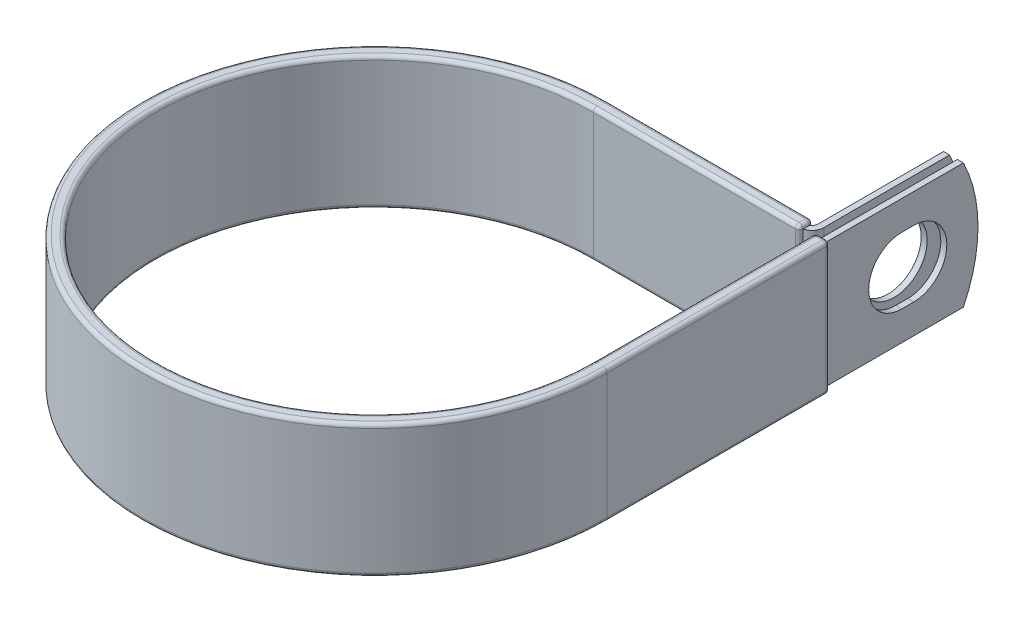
ISO-10303-21;
HEADER;
FILE_DESCRIPTION(('STEP AP214'),'2;1');
FILE_NAME('part.step','',(''),(''),'','','');
FILE_SCHEMA(('AUTOMOTIVE_DESIGN { 1 0 10303 214 1 1 1 1 }'));
ENDSEC;
DATA;
#1=APPLICATION_CONTEXT('core data for automotive mechanical design processes');
#2=APPLICATION_PROTOCOL_DEFINITION('international standard','automotive_design',2000,#1);
#3=PRODUCT_CONTEXT('',#1,'mechanical');
#4=PRODUCT('Part','Part','',(#3));
#5=PRODUCT_RELATED_PRODUCT_CATEGORY('part','',(#4));
#6=PRODUCT_DEFINITION_FORMATION('','',#4);
#7=PRODUCT_DEFINITION_CONTEXT('part definition',#1,'design');
#8=PRODUCT_DEFINITION('design','',#6,#7);
#9=PRODUCT_DEFINITION_SHAPE('','',#8);
#10=(LENGTH_UNIT() NAMED_UNIT(*) SI_UNIT(.MILLI.,.METRE.));
#11=(NAMED_UNIT(*) PLANE_ANGLE_UNIT() SI_UNIT($,.RADIAN.));
#12=(NAMED_UNIT(*) SI_UNIT($,.STERADIAN.) SOLID_ANGLE_UNIT());
#13=UNCERTAINTY_MEASURE_WITH_UNIT(LENGTH_MEASURE(1.E-05),#10,'distance_accuracy_value','');
#14=(GEOMETRIC_REPRESENTATION_CONTEXT(3) GLOBAL_UNCERTAINTY_ASSIGNED_CONTEXT((#13)) GLOBAL_UNIT_ASSIGNED_CONTEXT((#10,
#11,#12)) REPRESENTATION_CONTEXT('',''));
#15=CARTESIAN_POINT('',(0.,0.,0.));
#16=DIRECTION('',(0.,0.,1.));
#17=DIRECTION('',(1.,0.,0.));
#18=AXIS2_PLACEMENT_3D('',#15,#16,#17);
#19=CARTESIAN_POINT('',(43.66895,12.7,-76.1746));
#20=DIRECTION('',(1.,0.,0.));
#21=DIRECTION('',(0.,0.,-1.));
#22=AXIS2_PLACEMENT_3D('',#19,#20,#21);
#23=PLANE('',#22);
#24=CARTESIAN_POINT('',(43.66895,0.,-61.8998));
#25=DIRECTION('',(1.,0.,0.));
#26=DIRECTION('',(0.,0.,-1.));
#27=AXIS2_PLACEMENT_3D('',#24,#25,#26);
#28=CIRCLE('',#27,6.7437);
#29=CARTESIAN_POINT('',(43.66895,0.,-68.6435));
#30=VERTEX_POINT('',#29);
#31=EDGE_CURVE('E460',#30,#30,#28,.F.);
#32=ORIENTED_EDGE('',*,*,#31,.T.);
#33=EDGE_LOOP('',(#32));
#34=FACE_BOUND('',#33,.T.);
#35=DIRECTION('',(0.,0.,1.));
#36=VECTOR('',#35,1.);
#37=CARTESIAN_POINT('',(43.66895,-12.7,-76.1746));
#38=LINE('',#37,#36);
#39=CARTESIAN_POINT('',(43.66895,-12.7,-73.1972683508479));
#40=VERTEX_POINT('',#39);
#41=CARTESIAN_POINT('',(43.66895,-12.7,-47.62119));
#42=VERTEX_POINT('',#41);
#43=EDGE_CURVE('E482',#40,#42,#38,.T.);
#44=ORIENTED_EDGE('',*,*,#43,.F.);
#45=CARTESIAN_POINT('',(43.66895,0.,-47.5996));
#46=DIRECTION('',(1.,0.,0.));
#47=DIRECTION('',(0.,0.,-1.));
#48=AXIS2_PLACEMENT_3D('',#45,#46,#47);
#49=CIRCLE('',#48,28.575);
#50=CARTESIAN_POINT('',(43.66895,12.7,-73.1972683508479));
#51=VERTEX_POINT('',#50);
#52=EDGE_CURVE('E419',#40,#51,#49,.T.);
#53=ORIENTED_EDGE('',*,*,#52,.T.);
#54=DIRECTION('',(0.,0.,1.));
#55=VECTOR('',#54,1.);
#56=CARTESIAN_POINT('',(43.66895,12.7,-76.1746));
#57=LINE('',#56,#55);
#58=CARTESIAN_POINT('',(43.66895,12.7,-47.62119));
#59=VERTEX_POINT('',#58);
#60=EDGE_CURVE('E472',#51,#59,#57,.T.);
#61=ORIENTED_EDGE('',*,*,#60,.T.);
#62=DIRECTION('',(0.,-1.,0.));
#63=VECTOR('',#62,1.);
#64=CARTESIAN_POINT('',(43.66895,12.7,-47.62119));
#65=LINE('',#64,#63);
#66=EDGE_CURVE('E489',#59,#42,#65,.T.);
#67=ORIENTED_EDGE('',*,*,#66,.T.);
#68=EDGE_LOOP('',(#44,#53,#61,#67));
#69=FACE_BOUND('',#68,.T.);
#70=ADVANCED_FACE('F54',(#34,#69),#23,.T.);
#71=CARTESIAN_POINT('',(42.44975,12.7,-76.1746));
#72=DIRECTION('',(1.,0.,0.));
#73=DIRECTION('',(0.,0.,-1.));
#74=AXIS2_PLACEMENT_3D('',#71,#72,#73);
#75=PLANE('',#74);
#76=CARTESIAN_POINT('',(42.44975,0.,-61.8998));
#77=DIRECTION('',(-1.,0.,0.));
#78=DIRECTION('',(0.,0.,1.));
#79=AXIS2_PLACEMENT_3D('',#76,#77,#78);
#80=CIRCLE('',#79,6.7437);
#81=CARTESIAN_POINT('',(42.44975,0.,-55.1561));
#82=VERTEX_POINT('',#81);
#83=EDGE_CURVE('E457',#82,#82,#80,.T.);
#84=ORIENTED_EDGE('',*,*,#83,.F.);
#85=EDGE_LOOP('',(#84));
#86=FACE_BOUND('',#85,.T.);
#87=CARTESIAN_POINT('',(42.44975,0.,-47.5996));
#88=DIRECTION('',(-1.,0.,0.));
#89=DIRECTION('',(0.,0.,1.));
#90=AXIS2_PLACEMENT_3D('',#87,#88,#89);
#91=CIRCLE('',#90,28.575);
#92=CARTESIAN_POINT('',(42.44975,12.7,-73.1972683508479));
#93=VERTEX_POINT('',#92);
#94=CARTESIAN_POINT('',(42.44975,-12.7,-73.1972683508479));
#95=VERTEX_POINT('',#94);
#96=EDGE_CURVE('E411',#93,#95,#91,.T.);
#97=ORIENTED_EDGE('',*,*,#96,.T.);
#98=DIRECTION('',(0.,0.,1.));
#99=VECTOR('',#98,1.);
#100=CARTESIAN_POINT('',(42.44975,-12.7,-76.1746));
#101=LINE('',#100,#99);
#102=CARTESIAN_POINT('',(42.44975,-12.7,-47.62119));
#103=VERTEX_POINT('',#102);
#104=EDGE_CURVE('E484',#95,#103,#101,.T.);
#105=ORIENTED_EDGE('',*,*,#104,.T.);
#106=DIRECTION('',(0.,-1.,0.));
#107=VECTOR('',#106,1.);
#108=CARTESIAN_POINT('',(42.44975,12.7,-47.62119));
#109=LINE('',#108,#107);
#110=CARTESIAN_POINT('',(42.44975,12.7,-47.62119));
#111=VERTEX_POINT('',#110);
#112=EDGE_CURVE('E477',#111,#103,#109,.T.);
#113=ORIENTED_EDGE('',*,*,#112,.F.);
#114=DIRECTION('',(0.,0.,1.));
#115=VECTOR('',#114,1.);
#116=CARTESIAN_POINT('',(42.44975,12.7,-76.1746));
#117=LINE('',#116,#115);
#118=EDGE_CURVE('E474',#93,#111,#117,.T.);
#119=ORIENTED_EDGE('',*,*,#118,.F.);
#120=EDGE_LOOP('',(#97,#105,#113,#119));
#121=FACE_BOUND('',#120,.T.);
#122=ADVANCED_FACE('F788',(#86,#121),#75,.F.);
#123=CARTESIAN_POINT('',(0.,-12.7,0.));
#124=DIRECTION('',(0.,1.,0.));
#125=DIRECTION('',(1.,0.,0.));
#126=AXIS2_PLACEMENT_3D('',#123,#124,#125);
#127=PLANE('',#126);
#128=CARTESIAN_POINT('',(41.29151,-12.7,-47.62119));
#129=DIRECTION('',(0.,-1.,0.));
#130=DIRECTION('',(0.,0.,1.));
#131=AXIS2_PLACEMENT_3D('',#128,#129,#130);
#132=CIRCLE('',#131,2.37744);
#133=CARTESIAN_POINT('',(41.8147500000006,-12.7,-45.3020434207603));
#134=VERTEX_POINT('',#133);
#135=EDGE_CURVE('E479',#42,#134,#132,.T.);
#136=ORIENTED_EDGE('',*,*,#135,.T.);
#137=DIRECTION('',(0.,0.,-1.));
#138=VECTOR('',#137,1.);
#139=CARTESIAN_POINT('',(41.8147500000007,-12.7,-46.46295));
#140=LINE('',#139,#138);
#141=CARTESIAN_POINT('',(41.8147500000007,-12.7,-46.4947));
#142=VERTEX_POINT('',#141);
#143=EDGE_CURVE('E368',#134,#142,#140,.T.);
#144=ORIENTED_EDGE('',*,*,#143,.T.);
#145=CARTESIAN_POINT('',(41.0527500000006,-12.7,-46.4947));
#146=DIRECTION('',(0.,1.,0.));
#147=DIRECTION('',(0.,0.,1.));
#148=AXIS2_PLACEMENT_3D('',#145,#146,#147);
#149=CIRCLE('',#148,0.762);
#150=CARTESIAN_POINT('',(41.8093610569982,-12.7,-46.5851638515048));
#151=VERTEX_POINT('',#150);
#152=EDGE_CURVE('E554',#142,#151,#149,.T.);
#153=ORIENTED_EDGE('',*,*,#152,.T.);
#154=CARTESIAN_POINT('',(41.29151,-12.7,-47.62119));
#155=DIRECTION('',(0.,1.,0.));
#156=DIRECTION('',(1.,0.,0.));
#157=AXIS2_PLACEMENT_3D('',#154,#155,#156);
#158=CIRCLE('',#157,1.15824000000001);
#159=EDGE_CURVE('E77',#103,#151,#158,.F.);
#160=ORIENTED_EDGE('',*,*,#159,.F.);
#161=ORIENTED_EDGE('',*,*,#104,.F.);
#162=DIRECTION('',(-1.,0.,0.));
#163=VECTOR('',#162,1.);
#164=CARTESIAN_POINT('',(46.46295,-12.7,-73.1972683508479));
#165=LINE('',#164,#163);
#166=EDGE_CURVE('E498',#40,#95,#165,.T.);
#167=ORIENTED_EDGE('',*,*,#166,.F.);
#168=ORIENTED_EDGE('',*,*,#43,.T.);
#169=EDGE_LOOP('',(#136,#144,#153,#160,#161,#167,#168));
#170=FACE_BOUND('',#169,.T.);
#171=ADVANCED_FACE('F794',(#170),#127,.F.);
#172=CARTESIAN_POINT('',(0.,12.7,0.));
#173=DIRECTION('',(0.,1.,0.));
#174=DIRECTION('',(1.,0.,0.));
#175=AXIS2_PLACEMENT_3D('',#172,#173,#174);
#176=PLANE('',#175);
#177=DIRECTION('',(0.,0.,-1.));
#178=VECTOR('',#177,1.);
#179=CARTESIAN_POINT('',(41.81475,12.7,5.86542092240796E-13));
#180=LINE('',#179,#178);
#181=CARTESIAN_POINT('',(41.8147500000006,12.7,-45.3020434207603));
#182=VERTEX_POINT('',#181);
#183=CARTESIAN_POINT('',(41.8147500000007,12.7,-46.4947));
#184=VERTEX_POINT('',#183);
#185=EDGE_CURVE('E405',#182,#184,#180,.T.);
#186=ORIENTED_EDGE('',*,*,#185,.F.);
#187=CARTESIAN_POINT('',(41.29151,12.7,-47.62119));
#188=DIRECTION('',(0.,-1.,0.));
#189=DIRECTION('',(0.,0.,1.));
#190=AXIS2_PLACEMENT_3D('',#187,#188,#189);
#191=CIRCLE('',#190,2.37744);
#192=EDGE_CURVE('E469',#59,#182,#191,.T.);
#193=ORIENTED_EDGE('',*,*,#192,.F.);
#194=ORIENTED_EDGE('',*,*,#60,.F.);
#195=DIRECTION('',(-1.,0.,0.));
#196=VECTOR('',#195,1.);
#197=CARTESIAN_POINT('',(46.46295,12.7,-73.1972683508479));
#198=LINE('',#197,#196);
#199=EDGE_CURVE('E495',#51,#93,#198,.T.);
#200=ORIENTED_EDGE('',*,*,#199,.T.);
#201=ORIENTED_EDGE('',*,*,#118,.T.);
#202=CARTESIAN_POINT('',(41.29151,12.7,-47.62119));
#203=DIRECTION('',(0.,1.,0.));
#204=DIRECTION('',(1.,0.,0.));
#205=AXIS2_PLACEMENT_3D('',#202,#203,#204);
#206=CIRCLE('',#205,1.15824000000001);
#207=CARTESIAN_POINT('',(41.8093610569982,12.7,-46.5851638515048));
#208=VERTEX_POINT('',#207);
#209=EDGE_CURVE('E70',#111,#208,#206,.F.);
#210=ORIENTED_EDGE('',*,*,#209,.T.);
#211=CARTESIAN_POINT('',(41.0527500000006,12.7,-46.4947));
#212=DIRECTION('',(0.,1.,0.));
#213=DIRECTION('',(0.,0.,1.));
#214=AXIS2_PLACEMENT_3D('',#211,#212,#213);
#215=CIRCLE('',#214,0.762);
#216=EDGE_CURVE('E12',#208,#184,#215,.F.);
#217=ORIENTED_EDGE('',*,*,#216,.T.);
#218=EDGE_LOOP('',(#186,#193,#194,#200,#201,#210,#217));
#219=FACE_BOUND('',#218,.T.);
#220=ADVANCED_FACE('F802',(#219),#176,.T.);
#221=CARTESIAN_POINT('',(41.29151,12.7,-47.62119));
#222=DIRECTION('',(0.,-1.,0.));
#223=DIRECTION('',(0.,0.,-1.));
#224=AXIS2_PLACEMENT_3D('',#221,#222,#223);
#225=CYLINDRICAL_SURFACE('',#224,2.37744);
#226=ORIENTED_EDGE('',*,*,#135,.F.);
#227=ORIENTED_EDGE('',*,*,#66,.F.);
#228=ORIENTED_EDGE('',*,*,#192,.T.);
#229=CARTESIAN_POINT('',(41.29151,12.7,-47.62119));
#230=DIRECTION('',(0.,-1.,0.));
#231=DIRECTION('',(0.,0.,-1.));
#232=AXIS2_PLACEMENT_3D('',#229,#230,#231);
#233=CIRCLE('',#232,2.37744);
#234=CARTESIAN_POINT('',(41.29151,12.7,-45.24375));
#235=VERTEX_POINT('',#234);
#236=EDGE_CURVE('E402',#235,#182,#233,.F.);
#237=ORIENTED_EDGE('',*,*,#236,.F.);
#238=DIRECTION('',(0.,-1.,0.));
#239=VECTOR('',#238,1.);
#240=CARTESIAN_POINT('',(41.29151,12.7,-45.24375));
#241=LINE('',#240,#239);
#242=CARTESIAN_POINT('',(41.29151,-12.7,-45.24375));
#243=VERTEX_POINT('',#242);
#244=EDGE_CURVE('E492',#235,#243,#241,.T.);
#245=ORIENTED_EDGE('',*,*,#244,.T.);
#246=CARTESIAN_POINT('',(41.29151,-12.7,-47.62119));
#247=DIRECTION('',(0.,1.,0.));
#248=DIRECTION('',(0.,0.,1.));
#249=AXIS2_PLACEMENT_3D('',#246,#247,#248);
#250=CIRCLE('',#249,2.37744);
#251=EDGE_CURVE('E400',#134,#243,#250,.F.);
#252=ORIENTED_EDGE('',*,*,#251,.F.);
#253=EDGE_LOOP('',(#226,#227,#228,#237,#245,#252));
#254=FACE_BOUND('',#253,.T.);
#255=ADVANCED_FACE('F799',(#254),#225,.T.);
#256=CARTESIAN_POINT('',(41.29151,12.7,-47.62119));
#257=DIRECTION('',(0.,-1.,0.));
#258=DIRECTION('',(0.,0.,-1.));
#259=AXIS2_PLACEMENT_3D('',#256,#257,#258);
#260=CYLINDRICAL_SURFACE('',#259,1.15824000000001);
#261=ORIENTED_EDGE('',*,*,#159,.T.);
#262=DIRECTION('',(0.,1.,0.));
#263=VECTOR('',#262,1.);
#264=CARTESIAN_POINT('',(41.8093610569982,-12.7,-46.5851638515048));
#265=LINE('',#264,#263);
#266=EDGE_CURVE('E63',#151,#208,#265,.T.);
#267=ORIENTED_EDGE('',*,*,#266,.T.);
#268=ORIENTED_EDGE('',*,*,#209,.F.);
#269=ORIENTED_EDGE('',*,*,#112,.T.);
#270=EDGE_LOOP('',(#261,#267,#268,#269));
#271=FACE_BOUND('',#270,.T.);
#272=ADVANCED_FACE('F801',(#271),#260,.F.);
#273=CARTESIAN_POINT('',(62.7430140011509,0.,-61.8998));
#274=DIRECTION('',(-1.,0.,0.));
#275=DIRECTION('',(0.,0.,1.));
#276=AXIS2_PLACEMENT_3D('',#273,#274,#275);
#277=CYLINDRICAL_SURFACE('',#276,6.7437);
#278=ORIENTED_EDGE('',*,*,#83,.T.);
#279=EDGE_LOOP('',(#278));
#280=FACE_BOUND('',#279,.T.);
#281=ORIENTED_EDGE('',*,*,#31,.F.);
#282=EDGE_LOOP('',(#281));
#283=FACE_BOUND('',#282,.T.);
#284=ADVANCED_FACE('F808',(#280,#283),#277,.F.);
#285=CARTESIAN_POINT('',(46.46295,0.,-47.5996));
#286=DIRECTION('',(-1.,0.,0.));
#287=DIRECTION('',(0.,0.,1.));
#288=AXIS2_PLACEMENT_3D('',#285,#286,#287);
#289=CYLINDRICAL_SURFACE('',#288,28.575);
#290=ORIENTED_EDGE('',*,*,#52,.F.);
#291=ORIENTED_EDGE('',*,*,#166,.T.);
#292=ORIENTED_EDGE('',*,*,#96,.F.);
#293=ORIENTED_EDGE('',*,*,#199,.F.);
#294=EDGE_LOOP('',(#290,#291,#292,#293));
#295=FACE_BOUND('',#294,.T.);
#296=ADVANCED_FACE('F859',(#295),#289,.T.);
#297=CARTESIAN_POINT('',(6.34641215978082E-13,-12.7,-45.24375));
#298=DIRECTION('',(0.,0.,1.));
#299=DIRECTION('',(1.,0.,0.));
#300=AXIS2_PLACEMENT_3D('',#297,#298,#299);
#301=PLANE('',#300);
#302=DIRECTION('',(1.,0.,0.));
#303=VECTOR('',#302,1.);
#304=CARTESIAN_POINT('',(6.34641215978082E-13,-12.7,-45.24375));
#305=LINE('',#304,#303);
#306=CARTESIAN_POINT('',(41.8147500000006,-12.7,-45.24375));
#307=VERTEX_POINT('',#306);
#308=EDGE_CURVE('E375',#243,#307,#305,.T.);
#309=ORIENTED_EDGE('',*,*,#308,.F.);
#310=ORIENTED_EDGE('',*,*,#244,.F.);
#311=DIRECTION('',(1.,0.,0.));
#312=VECTOR('',#311,1.);
#313=CARTESIAN_POINT('',(6.34641215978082E-13,12.7,-45.24375));
#314=LINE('',#313,#312);
#315=CARTESIAN_POINT('',(41.8147500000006,12.7,-45.24375));
#316=VERTEX_POINT('',#315);
#317=EDGE_CURVE('E377',#235,#316,#314,.T.);
#318=ORIENTED_EDGE('',*,*,#317,.T.);
#319=DIRECTION('',(0.,-1.,0.));
#320=VECTOR('',#319,1.);
#321=CARTESIAN_POINT('',(41.8147500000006,-12.7,-45.24375));
#322=LINE('',#321,#320);
#323=EDGE_CURVE('E307',#316,#307,#322,.T.);
#324=ORIENTED_EDGE('',*,*,#323,.T.);
#325=EDGE_LOOP('',(#309,#310,#318,#324));
#326=FACE_BOUND('',#325,.T.);
#327=ADVANCED_FACE('F831',(#326),#301,.F.);
#328=CARTESIAN_POINT('',(41.8147500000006,-12.73175,-45.212));
#329=DIRECTION('',(1.,0.,0.));
#330=DIRECTION('',(0.,0.,-1.));
#331=AXIS2_PLACEMENT_3D('',#328,#329,#330);
#332=PLANE('',#331);
#333=DIRECTION('',(0.,0.,-1.));
#334=VECTOR('',#333,1.);
#335=CARTESIAN_POINT('',(41.8147500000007,-12.73175,-46.4947));
#336=LINE('',#335,#334);
#337=CARTESIAN_POINT('',(41.8147500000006,-12.73175,-45.212));
#338=VERTEX_POINT('',#337);
#339=CARTESIAN_POINT('',(41.8147500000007,-12.73175,-46.4947));
#340=VERTEX_POINT('',#339);
#341=EDGE_CURVE('E508',#338,#340,#336,.T.);
#342=ORIENTED_EDGE('',*,*,#341,.T.);
#343=DIRECTION('',(0.,1.,0.));
#344=VECTOR('',#343,1.);
#345=CARTESIAN_POINT('',(41.8147500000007,-12.73175,-46.4947));
#346=LINE('',#345,#344);
#347=EDGE_CURVE('E512',#340,#142,#346,.T.);
#348=ORIENTED_EDGE('',*,*,#347,.T.);
#349=ORIENTED_EDGE('',*,*,#143,.F.);
#350=EDGE_CURVE('E369',#307,#134,#140,.T.);
#351=ORIENTED_EDGE('',*,*,#350,.F.);
#352=ORIENTED_EDGE('',*,*,#323,.F.);
#353=DIRECTION('',(0.,0.,1.));
#354=VECTOR('',#353,1.);
#355=CARTESIAN_POINT('',(41.8147500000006,12.7,-45.24375));
#356=LINE('',#355,#354);
#357=EDGE_CURVE('E372',#182,#316,#356,.T.);
#358=ORIENTED_EDGE('',*,*,#357,.F.);
#359=ORIENTED_EDGE('',*,*,#185,.T.);
#360=DIRECTION('',(0.,1.,0.));
#361=VECTOR('',#360,1.);
#362=CARTESIAN_POINT('',(41.8147500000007,-12.73175,-46.4947));
#363=LINE('',#362,#361);
#364=CARTESIAN_POINT('',(41.8147500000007,12.73175,-46.4947));
#365=VERTEX_POINT('',#364);
#366=EDGE_CURVE('E510',#184,#365,#363,.T.);
#367=ORIENTED_EDGE('',*,*,#366,.T.);
#368=DIRECTION('',(0.,0.,1.));
#369=VECTOR('',#368,1.);
#370=CARTESIAN_POINT('',(41.8147500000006,12.73175,-45.212));
#371=LINE('',#370,#369);
#372=CARTESIAN_POINT('',(41.8147500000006,12.73175,-45.212));
#373=VERTEX_POINT('',#372);
#374=EDGE_CURVE('E504',#365,#373,#371,.T.);
#375=ORIENTED_EDGE('',*,*,#374,.T.);
#376=DIRECTION('',(0.,-1.,0.));
#377=VECTOR('',#376,1.);
#378=CARTESIAN_POINT('',(41.8147500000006,-12.73175,-45.212));
#379=LINE('',#378,#377);
#380=EDGE_CURVE('E506',#373,#338,#379,.T.);
#381=ORIENTED_EDGE('',*,*,#380,.T.);
#382=EDGE_LOOP('',(#342,#348,#349,#351,#352,#358,#359,#367,#375,#381));
#383=FACE_BOUND('',#382,.T.);
#384=ADVANCED_FACE('F827',(#383),#332,.T.);
#385=CARTESIAN_POINT('',(6.52188488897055E-13,-12.73175,-46.4947));
#386=DIRECTION('',(1.,0.,0.));
#387=DIRECTION('',(0.,0.,-1.));
#388=AXIS2_PLACEMENT_3D('',#385,#386,#387);
#389=CYLINDRICAL_SURFACE('',#388,0.761999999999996);
#390=DIRECTION('',(1.,0.,0.));
#391=VECTOR('',#390,1.);
#392=CARTESIAN_POINT('',(6.62877183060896E-13,-12.73175,-47.2567));
#393=LINE('',#392,#391);
#394=CARTESIAN_POINT('',(6.62877183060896E-13,-12.73175,-47.2567));
#395=VERTEX_POINT('',#394);
#396=CARTESIAN_POINT('',(41.0527500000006,-12.73175,-47.2567));
#397=VERTEX_POINT('',#396);
#398=EDGE_CURVE('E394',#395,#397,#393,.T.);
#399=ORIENTED_EDGE('',*,*,#398,.T.);
#400=CARTESIAN_POINT('',(41.0527500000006,-12.73175,-46.4947));
#401=DIRECTION('',(1.,0.,0.));
#402=DIRECTION('',(0.,0.,-1.));
#403=AXIS2_PLACEMENT_3D('',#400,#401,#402);
#404=CIRCLE('',#403,0.761999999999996);
#405=CARTESIAN_POINT('',(41.0527500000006,-13.49375,-46.4947));
#406=VERTEX_POINT('',#405);
#407=EDGE_CURVE('E517',#397,#406,#404,.F.);
#408=ORIENTED_EDGE('',*,*,#407,.T.);
#409=DIRECTION('',(1.,0.,0.));
#410=VECTOR('',#409,1.);
#411=CARTESIAN_POINT('',(6.52188488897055E-13,-13.49375,-46.4947));
#412=LINE('',#411,#410);
#413=CARTESIAN_POINT('',(6.52188488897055E-13,-13.49375,-46.4947));
#414=VERTEX_POINT('',#413);
#415=EDGE_CURVE('E397',#414,#406,#412,.T.);
#416=ORIENTED_EDGE('',*,*,#415,.F.);
#417=CARTESIAN_POINT('',(6.52188488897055E-13,-12.73175,-46.4947));
#418=DIRECTION('',(1.,0.,0.));
#419=DIRECTION('',(0.,0.,1.));
#420=AXIS2_PLACEMENT_3D('',#417,#418,#419);
#421=CIRCLE('',#420,0.761999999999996);
#422=EDGE_CURVE('E345',#414,#395,#421,.T.);
#423=ORIENTED_EDGE('',*,*,#422,.T.);
#424=EDGE_LOOP('',(#399,#408,#416,#423));
#425=FACE_BOUND('',#424,.T.);
#426=ADVANCED_FACE('F670',(#425),#389,.T.);
#427=CARTESIAN_POINT('',(6.62877183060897E-13,12.73175,-47.2567));
#428=DIRECTION('',(0.,0.,-1.));
#429=DIRECTION('',(0.,1.,0.));
#430=AXIS2_PLACEMENT_3D('',#427,#428,#429);
#431=PLANE('',#430);
#432=DIRECTION('',(1.,0.,0.));
#433=VECTOR('',#432,1.);
#434=CARTESIAN_POINT('',(6.62877183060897E-13,12.73175,-47.2567));
#435=LINE('',#434,#433);
#436=CARTESIAN_POINT('',(6.62877183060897E-13,12.73175,-47.2567));
#437=VERTEX_POINT('',#436);
#438=CARTESIAN_POINT('',(41.0527500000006,12.73175,-47.2567));
#439=VERTEX_POINT('',#438);
#440=EDGE_CURVE('E391',#437,#439,#435,.T.);
#441=ORIENTED_EDGE('',*,*,#440,.T.);
#442=DIRECTION('',(0.,1.,0.));
#443=VECTOR('',#442,1.);
#444=CARTESIAN_POINT('',(41.0527500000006,12.73175,-47.2567));
#445=LINE('',#444,#443);
#446=EDGE_CURVE('E515',#439,#397,#445,.F.);
#447=ORIENTED_EDGE('',*,*,#446,.T.);
#448=ORIENTED_EDGE('',*,*,#398,.F.);
#449=DIRECTION('',(0.,1.,0.));
#450=VECTOR('',#449,1.);
#451=CARTESIAN_POINT('',(6.62877183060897E-13,12.73175,-47.2567));
#452=LINE('',#451,#450);
#453=EDGE_CURVE('E342',#395,#437,#452,.T.);
#454=ORIENTED_EDGE('',*,*,#453,.T.);
#455=EDGE_LOOP('',(#441,#447,#448,#454));
#456=FACE_BOUND('',#455,.T.);
#457=ADVANCED_FACE('F676',(#456),#431,.T.);
#458=CARTESIAN_POINT('',(6.52188488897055E-13,12.73175,-46.4947));
#459=DIRECTION('',(1.,0.,0.));
#460=DIRECTION('',(0.,0.,-1.));
#461=AXIS2_PLACEMENT_3D('',#458,#459,#460);
#462=CYLINDRICAL_SURFACE('',#461,0.762);
#463=DIRECTION('',(1.,0.,0.));
#464=VECTOR('',#463,1.);
#465=CARTESIAN_POINT('',(6.52188488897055E-13,13.49375,-46.4947));
#466=LINE('',#465,#464);
#467=CARTESIAN_POINT('',(6.52188488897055E-13,13.49375,-46.4947));
#468=VERTEX_POINT('',#467);
#469=CARTESIAN_POINT('',(41.0527500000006,13.49375,-46.4947));
#470=VERTEX_POINT('',#469);
#471=EDGE_CURVE('E388',#468,#470,#466,.T.);
#472=ORIENTED_EDGE('',*,*,#471,.T.);
#473=CARTESIAN_POINT('',(41.0527500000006,12.73175,-46.4947));
#474=DIRECTION('',(1.,0.,0.));
#475=DIRECTION('',(0.,0.,-1.));
#476=AXIS2_PLACEMENT_3D('',#473,#474,#475);
#477=CIRCLE('',#476,0.762);
#478=EDGE_CURVE('E501',#470,#439,#477,.F.);
#479=ORIENTED_EDGE('',*,*,#478,.T.);
#480=ORIENTED_EDGE('',*,*,#440,.F.);
#481=CARTESIAN_POINT('',(6.52188488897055E-13,12.73175,-46.4947));
#482=DIRECTION('',(1.,0.,0.));
#483=DIRECTION('',(0.,0.,1.));
#484=AXIS2_PLACEMENT_3D('',#481,#482,#483);
#485=CIRCLE('',#484,0.762);
#486=EDGE_CURVE('E339',#437,#468,#485,.T.);
#487=ORIENTED_EDGE('',*,*,#486,.T.);
#488=EDGE_LOOP('',(#472,#479,#480,#487));
#489=FACE_BOUND('',#488,.T.);
#490=ADVANCED_FACE('F680',(#489),#462,.T.);
#491=CARTESIAN_POINT('',(6.34195853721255E-13,12.73175,-45.212));
#492=DIRECTION('',(1.,0.,0.));
#493=DIRECTION('',(0.,0.,-1.));
#494=AXIS2_PLACEMENT_3D('',#491,#492,#493);
#495=CYLINDRICAL_SURFACE('',#494,0.761999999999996);
#496=DIRECTION('',(1.,0.,0.));
#497=VECTOR('',#496,1.);
#498=CARTESIAN_POINT('',(6.23507159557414E-13,12.73175,-44.45));
#499=LINE('',#498,#497);
#500=CARTESIAN_POINT('',(6.23507159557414E-13,12.73175,-44.45));
#501=VERTEX_POINT('',#500);
#502=CARTESIAN_POINT('',(41.0527500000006,12.73175,-44.45));
#503=VERTEX_POINT('',#502);
#504=EDGE_CURVE('E382',#501,#503,#499,.T.);
#505=ORIENTED_EDGE('',*,*,#504,.T.);
#506=CARTESIAN_POINT('',(41.0527500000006,12.73175,-45.212));
#507=DIRECTION('',(1.,0.,0.));
#508=DIRECTION('',(0.,0.,-1.));
#509=AXIS2_PLACEMENT_3D('',#506,#507,#508);
#510=CIRCLE('',#509,0.761999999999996);
#511=CARTESIAN_POINT('',(41.0527500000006,13.49375,-45.212));
#512=VERTEX_POINT('',#511);
#513=EDGE_CURVE('E527',#503,#512,#510,.F.);
#514=ORIENTED_EDGE('',*,*,#513,.T.);
#515=DIRECTION('',(1.,0.,0.));
#516=VECTOR('',#515,1.);
#517=CARTESIAN_POINT('',(6.34195853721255E-13,13.49375,-45.212));
#518=LINE('',#517,#516);
#519=CARTESIAN_POINT('',(6.34195853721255E-13,13.49375,-45.212));
#520=VERTEX_POINT('',#519);
#521=EDGE_CURVE('E385',#520,#512,#518,.T.);
#522=ORIENTED_EDGE('',*,*,#521,.F.);
#523=CARTESIAN_POINT('',(6.34195853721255E-13,12.73175,-45.212));
#524=DIRECTION('',(1.,0.,0.));
#525=DIRECTION('',(0.,0.,1.));
#526=AXIS2_PLACEMENT_3D('',#523,#524,#525);
#527=CIRCLE('',#526,0.761999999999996);
#528=EDGE_CURVE('E336',#520,#501,#527,.T.);
#529=ORIENTED_EDGE('',*,*,#528,.T.);
#530=EDGE_LOOP('',(#505,#514,#522,#529));
#531=FACE_BOUND('',#530,.T.);
#532=ADVANCED_FACE('F721',(#531),#495,.T.);
#533=CARTESIAN_POINT('',(6.23507159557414E-13,-12.73175,-44.45));
#534=DIRECTION('',(0.,0.,1.));
#535=DIRECTION('',(0.,-1.,0.));
#536=AXIS2_PLACEMENT_3D('',#533,#534,#535);
#537=PLANE('',#536);
#538=DIRECTION('',(1.,0.,0.));
#539=VECTOR('',#538,1.);
#540=CARTESIAN_POINT('',(6.23507159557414E-13,-12.73175,-44.45));
#541=LINE('',#540,#539);
#542=CARTESIAN_POINT('',(6.23507159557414E-13,-12.73175,-44.45));
#543=VERTEX_POINT('',#542);
#544=CARTESIAN_POINT('',(41.0527500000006,-12.73175,-44.45));
#545=VERTEX_POINT('',#544);
#546=EDGE_CURVE('E379',#543,#545,#541,.T.);
#547=ORIENTED_EDGE('',*,*,#546,.T.);
#548=DIRECTION('',(0.,-1.,0.));
#549=VECTOR('',#548,1.);
#550=CARTESIAN_POINT('',(41.0527500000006,-12.73175,-44.45));
#551=LINE('',#550,#549);
#552=EDGE_CURVE('E525',#545,#503,#551,.F.);
#553=ORIENTED_EDGE('',*,*,#552,.T.);
#554=ORIENTED_EDGE('',*,*,#504,.F.);
#555=DIRECTION('',(0.,-1.,0.));
#556=VECTOR('',#555,1.);
#557=CARTESIAN_POINT('',(6.23507159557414E-13,-12.73175,-44.45));
#558=LINE('',#557,#556);
#559=EDGE_CURVE('E327',#501,#543,#558,.T.);
#560=ORIENTED_EDGE('',*,*,#559,.T.);
#561=EDGE_LOOP('',(#547,#553,#554,#560));
#562=FACE_BOUND('',#561,.T.);
#563=ADVANCED_FACE('F719',(#562),#537,.T.);
#564=CARTESIAN_POINT('',(6.34195853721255E-13,-12.73175,-45.212));
#565=DIRECTION('',(1.,0.,0.));
#566=DIRECTION('',(0.,0.,-1.));
#567=AXIS2_PLACEMENT_3D('',#564,#565,#566);
#568=CYLINDRICAL_SURFACE('',#567,0.762000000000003);
#569=DIRECTION('',(1.,0.,0.));
#570=VECTOR('',#569,1.);
#571=CARTESIAN_POINT('',(6.34195853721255E-13,-13.49375,-45.212));
#572=LINE('',#571,#570);
#573=CARTESIAN_POINT('',(6.34195853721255E-13,-13.49375,-45.212));
#574=VERTEX_POINT('',#573);
#575=CARTESIAN_POINT('',(41.0527500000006,-13.49375,-45.212));
#576=VERTEX_POINT('',#575);
#577=EDGE_CURVE('E303',#574,#576,#572,.T.);
#578=ORIENTED_EDGE('',*,*,#577,.T.);
#579=CARTESIAN_POINT('',(41.0527500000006,-12.73175,-45.212));
#580=DIRECTION('',(1.,0.,0.));
#581=DIRECTION('',(0.,0.,-1.));
#582=AXIS2_PLACEMENT_3D('',#579,#580,#581);
#583=CIRCLE('',#582,0.762000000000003);
#584=EDGE_CURVE('E523',#576,#545,#583,.F.);
#585=ORIENTED_EDGE('',*,*,#584,.T.);
#586=ORIENTED_EDGE('',*,*,#546,.F.);
#587=CARTESIAN_POINT('',(6.34195853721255E-13,-12.73175,-45.212));
#588=DIRECTION('',(1.,0.,0.));
#589=DIRECTION('',(0.,0.,-1.));
#590=AXIS2_PLACEMENT_3D('',#587,#588,#589);
#591=CIRCLE('',#590,0.762000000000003);
#592=EDGE_CURVE('E324',#543,#574,#591,.T.);
#593=ORIENTED_EDGE('',*,*,#592,.T.);
#594=EDGE_LOOP('',(#578,#585,#586,#593));
#595=FACE_BOUND('',#594,.T.);
#596=ADVANCED_FACE('F709',(#595),#568,.T.);
#597=CARTESIAN_POINT('',(0.,-12.73175,0.));
#598=DIRECTION('',(0.,-1.,0.));
#599=DIRECTION('',(0.,0.,-1.));
#600=AXIS2_PLACEMENT_3D('',#597,#598,#599);
#601=TOROIDAL_SURFACE('',#600,46.4947,0.761999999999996);
#602=CARTESIAN_POINT('',(46.4947,-12.73175,0.));
#603=DIRECTION('',(0.,0.,1.));
#604=DIRECTION('',(-1.,0.,0.));
#605=AXIS2_PLACEMENT_3D('',#602,#603,#604);
#606=CIRCLE('',#605,0.761999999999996);
#607=CARTESIAN_POINT('',(46.4947,-13.49375,0.));
#608=VERTEX_POINT('',#607);
#609=CARTESIAN_POINT('',(47.2567,-12.73175,0.));
#610=VERTEX_POINT('',#609);
#611=EDGE_CURVE('E318',#608,#610,#606,.T.);
#612=ORIENTED_EDGE('',*,*,#611,.T.);
#613=CARTESIAN_POINT('',(0.,-12.73175,0.));
#614=DIRECTION('',(0.,-1.,0.));
#615=DIRECTION('',(0.,0.,-1.));
#616=AXIS2_PLACEMENT_3D('',#613,#614,#615);
#617=CIRCLE('',#616,47.2567);
#618=EDGE_CURVE('E361',#610,#395,#617,.T.);
#619=ORIENTED_EDGE('',*,*,#618,.T.);
#620=ORIENTED_EDGE('',*,*,#422,.F.);
#621=CARTESIAN_POINT('',(0.,-13.49375,0.));
#622=DIRECTION('',(0.,-1.,0.));
#623=DIRECTION('',(0.,0.,-1.));
#624=AXIS2_PLACEMENT_3D('',#621,#622,#623);
#625=CIRCLE('',#624,46.4947);
#626=EDGE_CURVE('E308',#608,#414,#625,.T.);
#627=ORIENTED_EDGE('',*,*,#626,.F.);
#628=EDGE_LOOP('',(#612,#619,#620,#627));
#629=FACE_BOUND('',#628,.T.);
#630=ADVANCED_FACE('F667',(#629),#601,.T.);
#631=CARTESIAN_POINT('',(0.,12.7,0.));
#632=DIRECTION('',(0.,-1.,0.));
#633=DIRECTION('',(0.,0.,-1.));
#634=AXIS2_PLACEMENT_3D('',#631,#632,#633);
#635=CYLINDRICAL_SURFACE('',#634,47.2567);
#636=DIRECTION('',(0.,1.,0.));
#637=VECTOR('',#636,1.);
#638=CARTESIAN_POINT('',(47.2567,12.73175,0.));
#639=LINE('',#638,#637);
#640=CARTESIAN_POINT('',(47.2567,12.73175,0.));
#641=VERTEX_POINT('',#640);
#642=EDGE_CURVE('E655',#610,#641,#639,.T.);
#643=ORIENTED_EDGE('',*,*,#642,.T.);
#644=CARTESIAN_POINT('',(0.,12.73175,0.));
#645=DIRECTION('',(0.,-1.,0.));
#646=DIRECTION('',(0.,0.,-1.));
#647=AXIS2_PLACEMENT_3D('',#644,#645,#646);
#648=CIRCLE('',#647,47.2567);
#649=EDGE_CURVE('E358',#641,#437,#648,.T.);
#650=ORIENTED_EDGE('',*,*,#649,.T.);
#651=ORIENTED_EDGE('',*,*,#453,.F.);
#652=ORIENTED_EDGE('',*,*,#618,.F.);
#653=EDGE_LOOP('',(#643,#650,#651,#652));
#654=FACE_BOUND('',#653,.T.);
#655=ADVANCED_FACE('F673',(#654),#635,.T.);
#656=CARTESIAN_POINT('',(0.,12.73175,0.));
#657=DIRECTION('',(0.,-1.,0.));
#658=DIRECTION('',(0.,0.,-1.));
#659=AXIS2_PLACEMENT_3D('',#656,#657,#658);
#660=TOROIDAL_SURFACE('',#659,46.4947,0.762);
#661=CARTESIAN_POINT('',(46.4947,12.73175,0.));
#662=DIRECTION('',(0.,0.,1.));
#663=DIRECTION('',(-1.,0.,0.));
#664=AXIS2_PLACEMENT_3D('',#661,#662,#663);
#665=CIRCLE('',#664,0.762);
#666=CARTESIAN_POINT('',(46.4947,13.49375,0.));
#667=VERTEX_POINT('',#666);
#668=EDGE_CURVE('E734',#641,#667,#665,.T.);
#669=ORIENTED_EDGE('',*,*,#668,.T.);
#670=CARTESIAN_POINT('',(0.,13.49375,0.));
#671=DIRECTION('',(0.,-1.,0.));
#672=DIRECTION('',(0.,0.,-1.));
#673=AXIS2_PLACEMENT_3D('',#670,#671,#672);
#674=CIRCLE('',#673,46.4947);
#675=EDGE_CURVE('E355',#667,#468,#674,.T.);
#676=ORIENTED_EDGE('',*,*,#675,.T.);
#677=ORIENTED_EDGE('',*,*,#486,.F.);
#678=ORIENTED_EDGE('',*,*,#649,.F.);
#679=EDGE_LOOP('',(#669,#676,#677,#678));
#680=FACE_BOUND('',#679,.T.);
#681=ADVANCED_FACE('F678',(#680),#660,.T.);
#682=CARTESIAN_POINT('',(0.,12.73175,0.));
#683=DIRECTION('',(0.,-1.,0.));
#684=DIRECTION('',(0.,0.,-1.));
#685=AXIS2_PLACEMENT_3D('',#682,#683,#684);
#686=TOROIDAL_SURFACE('',#685,45.212,0.761999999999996);
#687=CARTESIAN_POINT('',(45.212,12.73175,0.));
#688=DIRECTION('',(0.,0.,1.));
#689=DIRECTION('',(-1.,0.,0.));
#690=AXIS2_PLACEMENT_3D('',#687,#688,#689);
#691=CIRCLE('',#690,0.761999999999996);
#692=CARTESIAN_POINT('',(45.212,13.49375,0.));
#693=VERTEX_POINT('',#692);
#694=CARTESIAN_POINT('',(44.45,12.73175,0.));
#695=VERTEX_POINT('',#694);
#696=EDGE_CURVE('E730',#693,#695,#691,.T.);
#697=ORIENTED_EDGE('',*,*,#696,.T.);
#698=CARTESIAN_POINT('',(0.,12.73175,0.));
#699=DIRECTION('',(0.,-1.,0.));
#700=DIRECTION('',(0.,0.,-1.));
#701=AXIS2_PLACEMENT_3D('',#698,#699,#700);
#702=CIRCLE('',#701,44.45);
#703=EDGE_CURVE('E349',#695,#501,#702,.T.);
#704=ORIENTED_EDGE('',*,*,#703,.T.);
#705=ORIENTED_EDGE('',*,*,#528,.F.);
#706=CARTESIAN_POINT('',(0.,13.49375,0.));
#707=DIRECTION('',(0.,-1.,0.));
#708=DIRECTION('',(0.,0.,-1.));
#709=AXIS2_PLACEMENT_3D('',#706,#707,#708);
#710=CIRCLE('',#709,45.212);
#711=EDGE_CURVE('E352',#693,#520,#710,.T.);
#712=ORIENTED_EDGE('',*,*,#711,.F.);
#713=EDGE_LOOP('',(#697,#704,#705,#712));
#714=FACE_BOUND('',#713,.T.);
#715=ADVANCED_FACE('F728',(#714),#686,.T.);
#716=CARTESIAN_POINT('',(0.,12.7,0.));
#717=DIRECTION('',(0.,-1.,0.));
#718=DIRECTION('',(0.,0.,-1.));
#719=AXIS2_PLACEMENT_3D('',#716,#717,#718);
#720=CYLINDRICAL_SURFACE('',#719,44.45);
#721=DIRECTION('',(0.,-1.,0.));
#722=VECTOR('',#721,1.);
#723=CARTESIAN_POINT('',(44.45,-12.73175,0.));
#724=LINE('',#723,#722);
#725=CARTESIAN_POINT('',(44.45,-12.73175,0.));
#726=VERTEX_POINT('',#725);
#727=EDGE_CURVE('E733',#695,#726,#724,.T.);
#728=ORIENTED_EDGE('',*,*,#727,.T.);
#729=CARTESIAN_POINT('',(0.,-12.73175,0.));
#730=DIRECTION('',(0.,-1.,0.));
#731=DIRECTION('',(0.,0.,-1.));
#732=AXIS2_PLACEMENT_3D('',#729,#730,#731);
#733=CIRCLE('',#732,44.45);
#734=EDGE_CURVE('E314',#726,#543,#733,.T.);
#735=ORIENTED_EDGE('',*,*,#734,.T.);
#736=ORIENTED_EDGE('',*,*,#559,.F.);
#737=ORIENTED_EDGE('',*,*,#703,.F.);
#738=EDGE_LOOP('',(#728,#735,#736,#737));
#739=FACE_BOUND('',#738,.T.);
#740=ADVANCED_FACE('F726',(#739),#720,.F.);
#741=CARTESIAN_POINT('',(0.,-12.73175,0.));
#742=DIRECTION('',(0.,-1.,0.));
#743=DIRECTION('',(0.,0.,-1.));
#744=AXIS2_PLACEMENT_3D('',#741,#742,#743);
#745=TOROIDAL_SURFACE('',#744,45.212,0.762000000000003);
#746=CARTESIAN_POINT('',(45.212,-12.73175,0.));
#747=DIRECTION('',(0.,0.,1.));
#748=DIRECTION('',(1.,0.,0.));
#749=AXIS2_PLACEMENT_3D('',#746,#747,#748);
#750=CIRCLE('',#749,0.762000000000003);
#751=CARTESIAN_POINT('',(45.212,-13.49375,0.));
#752=VERTEX_POINT('',#751);
#753=EDGE_CURVE('E311',#726,#752,#750,.T.);
#754=ORIENTED_EDGE('',*,*,#753,.T.);
#755=CARTESIAN_POINT('',(0.,-13.49375,0.));
#756=DIRECTION('',(0.,-1.,0.));
#757=DIRECTION('',(0.,0.,-1.));
#758=AXIS2_PLACEMENT_3D('',#755,#756,#757);
#759=CIRCLE('',#758,45.212);
#760=EDGE_CURVE('E295',#752,#574,#759,.T.);
#761=ORIENTED_EDGE('',*,*,#760,.T.);
#762=ORIENTED_EDGE('',*,*,#592,.F.);
#763=ORIENTED_EDGE('',*,*,#734,.F.);
#764=EDGE_LOOP('',(#754,#761,#762,#763));
#765=FACE_BOUND('',#764,.T.);
#766=ADVANCED_FACE('F312',(#765),#745,.T.);
#767=CARTESIAN_POINT('',(45.212,-12.73175,0.));
#768=DIRECTION('',(0.,0.,-1.));
#769=DIRECTION('',(-1.,0.,0.));
#770=AXIS2_PLACEMENT_3D('',#767,#768,#769);
#771=CYLINDRICAL_SURFACE('',#770,0.762000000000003);
#772=DIRECTION('',(0.,0.,-1.));
#773=VECTOR('',#772,1.);
#774=CARTESIAN_POINT('',(44.45,-12.73175,0.));
#775=LINE('',#774,#773);
#776=CARTESIAN_POINT('',(44.45,-12.73175,-44.48175));
#777=VERTEX_POINT('',#776);
#778=EDGE_CURVE('E741',#726,#777,#775,.T.);
#779=ORIENTED_EDGE('',*,*,#778,.T.);
#780=CARTESIAN_POINT('',(45.212,-12.73175,-44.48175));
#781=DIRECTION('',(0.,0.,-1.));
#782=DIRECTION('',(-1.,0.,0.));
#783=AXIS2_PLACEMENT_3D('',#780,#781,#782);
#784=CIRCLE('',#783,0.762000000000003);
#785=CARTESIAN_POINT('',(45.212,-13.49375,-44.48175));
#786=VERTEX_POINT('',#785);
#787=EDGE_CURVE('E323',#777,#786,#784,.F.);
#788=ORIENTED_EDGE('',*,*,#787,.T.);
#789=DIRECTION('',(0.,0.,-1.));
#790=VECTOR('',#789,1.);
#791=CARTESIAN_POINT('',(45.212,-13.49375,0.));
#792=LINE('',#791,#790);
#793=EDGE_CURVE('E300',#752,#786,#792,.T.);
#794=ORIENTED_EDGE('',*,*,#793,.F.);
#795=ORIENTED_EDGE('',*,*,#753,.F.);
#796=EDGE_LOOP('',(#779,#788,#794,#795));
#797=FACE_BOUND('',#796,.T.);
#798=ADVANCED_FACE('F321',(#797),#771,.T.);
#799=CARTESIAN_POINT('',(46.4947,-13.49375,0.));
#800=DIRECTION('',(0.,1.,0.));
#801=DIRECTION('',(0.,0.,1.));
#802=AXIS2_PLACEMENT_3D('',#799,#800,#801);
#803=PLANE('',#802);
#804=ORIENTED_EDGE('',*,*,#415,.T.);
#805=DIRECTION('',(0.,0.,-1.));
#806=VECTOR('',#805,1.);
#807=CARTESIAN_POINT('',(41.0527500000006,-13.49375,-45.212));
#808=LINE('',#807,#806);
#809=EDGE_CURVE('E521',#406,#576,#808,.F.);
#810=ORIENTED_EDGE('',*,*,#809,.T.);
#811=ORIENTED_EDGE('',*,*,#577,.F.);
#812=ORIENTED_EDGE('',*,*,#760,.F.);
#813=ORIENTED_EDGE('',*,*,#793,.T.);
#814=DIRECTION('',(1.,0.,0.));
#815=VECTOR('',#814,1.);
#816=CARTESIAN_POINT('',(46.4947,-13.49375,-44.48175));
#817=LINE('',#816,#815);
#818=CARTESIAN_POINT('',(46.4947,-13.49375,-44.48175));
#819=VERTEX_POINT('',#818);
#820=EDGE_CURVE('E519',#786,#819,#817,.T.);
#821=ORIENTED_EDGE('',*,*,#820,.T.);
#822=DIRECTION('',(0.,0.,-1.));
#823=VECTOR('',#822,1.);
#824=CARTESIAN_POINT('',(46.4947,-13.49375,0.));
#825=LINE('',#824,#823);
#826=EDGE_CURVE('E325',#608,#819,#825,.T.);
#827=ORIENTED_EDGE('',*,*,#826,.F.);
#828=ORIENTED_EDGE('',*,*,#626,.T.);
#829=EDGE_LOOP('',(#804,#810,#811,#812,#813,#821,#827,#828));
#830=FACE_BOUND('',#829,.T.);
#831=ADVANCED_FACE('F298',(#830),#803,.F.);
#832=CARTESIAN_POINT('',(46.4947,-12.73175,0.));
#833=DIRECTION('',(0.,0.,-1.));
#834=DIRECTION('',(-1.,0.,0.));
#835=AXIS2_PLACEMENT_3D('',#832,#833,#834);
#836=CYLINDRICAL_SURFACE('',#835,0.761999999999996);
#837=ORIENTED_EDGE('',*,*,#826,.T.);
#838=CARTESIAN_POINT('',(46.4947,-12.73175,-44.48175));
#839=DIRECTION('',(0.,0.,-1.));
#840=DIRECTION('',(-1.,0.,0.));
#841=AXIS2_PLACEMENT_3D('',#838,#839,#840);
#842=CIRCLE('',#841,0.761999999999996);
#843=CARTESIAN_POINT('',(47.2567,-12.73175,-44.48175));
#844=VERTEX_POINT('',#843);
#845=EDGE_CURVE('E543',#819,#844,#842,.F.);
#846=ORIENTED_EDGE('',*,*,#845,.T.);
#847=DIRECTION('',(0.,0.,-1.));
#848=VECTOR('',#847,1.);
#849=CARTESIAN_POINT('',(47.2567,-12.73175,0.));
#850=LINE('',#849,#848);
#851=EDGE_CURVE('E330',#610,#844,#850,.T.);
#852=ORIENTED_EDGE('',*,*,#851,.F.);
#853=ORIENTED_EDGE('',*,*,#611,.F.);
#854=EDGE_LOOP('',(#837,#846,#852,#853));
#855=FACE_BOUND('',#854,.T.);
#856=ADVANCED_FACE('F661',(#855),#836,.T.);
#857=CARTESIAN_POINT('',(47.2567,12.73175,0.));
#858=DIRECTION('',(-1.,0.,0.));
#859=DIRECTION('',(0.,-1.,0.));
#860=AXIS2_PLACEMENT_3D('',#857,#858,#859);
#861=PLANE('',#860);
#862=ORIENTED_EDGE('',*,*,#851,.T.);
#863=DIRECTION('',(0.,1.,0.));
#864=VECTOR('',#863,1.);
#865=CARTESIAN_POINT('',(47.2567,12.73175,-44.48175));
#866=LINE('',#865,#864);
#867=CARTESIAN_POINT('',(47.2567,12.73175,-44.48175));
#868=VERTEX_POINT('',#867);
#869=EDGE_CURVE('E532',#844,#868,#866,.T.);
#870=ORIENTED_EDGE('',*,*,#869,.T.);
#871=DIRECTION('',(0.,0.,-1.));
#872=VECTOR('',#871,1.);
#873=CARTESIAN_POINT('',(47.2567,12.73175,0.));
#874=LINE('',#873,#872);
#875=EDGE_CURVE('E640',#641,#868,#874,.T.);
#876=ORIENTED_EDGE('',*,*,#875,.F.);
#877=ORIENTED_EDGE('',*,*,#642,.F.);
#878=EDGE_LOOP('',(#862,#870,#876,#877));
#879=FACE_BOUND('',#878,.T.);
#880=ADVANCED_FACE('F653',(#879),#861,.F.);
#881=CARTESIAN_POINT('',(46.4947,12.73175,0.));
#882=DIRECTION('',(0.,0.,-1.));
#883=DIRECTION('',(-1.,0.,0.));
#884=AXIS2_PLACEMENT_3D('',#881,#882,#883);
#885=CYLINDRICAL_SURFACE('',#884,0.762);
#886=ORIENTED_EDGE('',*,*,#875,.T.);
#887=CARTESIAN_POINT('',(46.4947,12.73175,-44.48175));
#888=DIRECTION('',(0.,0.,-1.));
#889=DIRECTION('',(-1.,0.,0.));
#890=AXIS2_PLACEMENT_3D('',#887,#888,#889);
#891=CIRCLE('',#890,0.762);
#892=CARTESIAN_POINT('',(46.4947,13.49375,-44.48175));
#893=VERTEX_POINT('',#892);
#894=EDGE_CURVE('E529',#868,#893,#891,.F.);
#895=ORIENTED_EDGE('',*,*,#894,.T.);
#896=DIRECTION('',(0.,0.,-1.));
#897=VECTOR('',#896,1.);
#898=CARTESIAN_POINT('',(46.4947,13.49375,0.));
#899=LINE('',#898,#897);
#900=EDGE_CURVE('E638',#667,#893,#899,.T.);
#901=ORIENTED_EDGE('',*,*,#900,.F.);
#902=ORIENTED_EDGE('',*,*,#668,.F.);
#903=EDGE_LOOP('',(#886,#895,#901,#902));
#904=FACE_BOUND('',#903,.T.);
#905=ADVANCED_FACE('F636',(#904),#885,.T.);
#906=CARTESIAN_POINT('',(45.212,13.49375,0.));
#907=DIRECTION('',(0.,-1.,0.));
#908=DIRECTION('',(0.,0.,-1.));
#909=AXIS2_PLACEMENT_3D('',#906,#907,#908);
#910=PLANE('',#909);
#911=ORIENTED_EDGE('',*,*,#521,.T.);
#912=DIRECTION('',(0.,0.,1.));
#913=VECTOR('',#912,1.);
#914=CARTESIAN_POINT('',(41.0527500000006,13.49375,-46.4947));
#915=LINE('',#914,#913);
#916=EDGE_CURVE('E552',#512,#470,#915,.F.);
#917=ORIENTED_EDGE('',*,*,#916,.T.);
#918=ORIENTED_EDGE('',*,*,#471,.F.);
#919=ORIENTED_EDGE('',*,*,#675,.F.);
#920=ORIENTED_EDGE('',*,*,#900,.T.);
#921=DIRECTION('',(-1.,0.,0.));
#922=VECTOR('',#921,1.);
#923=CARTESIAN_POINT('',(45.212,13.49375,-44.48175));
#924=LINE('',#923,#922);
#925=CARTESIAN_POINT('',(45.212,13.49375,-44.48175));
#926=VERTEX_POINT('',#925);
#927=EDGE_CURVE('E550',#893,#926,#924,.T.);
#928=ORIENTED_EDGE('',*,*,#927,.T.);
#929=DIRECTION('',(0.,0.,-1.));
#930=VECTOR('',#929,1.);
#931=CARTESIAN_POINT('',(45.212,13.49375,0.));
#932=LINE('',#931,#930);
#933=EDGE_CURVE('E643',#693,#926,#932,.T.);
#934=ORIENTED_EDGE('',*,*,#933,.F.);
#935=ORIENTED_EDGE('',*,*,#711,.T.);
#936=EDGE_LOOP('',(#911,#917,#918,#919,#920,#928,#934,#935));
#937=FACE_BOUND('',#936,.T.);
#938=ADVANCED_FACE('F641',(#937),#910,.F.);
#939=CARTESIAN_POINT('',(45.212,12.73175,0.));
#940=DIRECTION('',(0.,0.,-1.));
#941=DIRECTION('',(-1.,0.,0.));
#942=AXIS2_PLACEMENT_3D('',#939,#940,#941);
#943=CYLINDRICAL_SURFACE('',#942,0.761999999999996);
#944=ORIENTED_EDGE('',*,*,#933,.T.);
#945=CARTESIAN_POINT('',(45.212,12.73175,-44.48175));
#946=DIRECTION('',(0.,0.,-1.));
#947=DIRECTION('',(-1.,0.,0.));
#948=AXIS2_PLACEMENT_3D('',#945,#946,#947);
#949=CIRCLE('',#948,0.761999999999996);
#950=CARTESIAN_POINT('',(44.45,12.73175,-44.48175));
#951=VERTEX_POINT('',#950);
#952=EDGE_CURVE('E548',#926,#951,#949,.F.);
#953=ORIENTED_EDGE('',*,*,#952,.T.);
#954=DIRECTION('',(0.,0.,-1.));
#955=VECTOR('',#954,1.);
#956=CARTESIAN_POINT('',(44.45,12.73175,0.));
#957=LINE('',#956,#955);
#958=EDGE_CURVE('E646',#695,#951,#957,.T.);
#959=ORIENTED_EDGE('',*,*,#958,.F.);
#960=ORIENTED_EDGE('',*,*,#696,.F.);
#961=EDGE_LOOP('',(#944,#953,#959,#960));
#962=FACE_BOUND('',#961,.T.);
#963=ADVANCED_FACE('F738',(#962),#943,.T.);
#964=CARTESIAN_POINT('',(45.24375,12.7,0.));
#965=DIRECTION('',(0.,-1.,0.));
#966=DIRECTION('',(0.,0.,-1.));
#967=AXIS2_PLACEMENT_3D('',#964,#965,#966);
#968=PLANE('',#967);
#969=ORIENTED_EDGE('',*,*,#317,.F.);
#970=ORIENTED_EDGE('',*,*,#236,.T.);
#971=ORIENTED_EDGE('',*,*,#357,.T.);
#972=EDGE_LOOP('',(#969,#970,#971));
#973=FACE_BOUND('',#972,.T.);
#974=ADVANCED_FACE('F825',(#973),#968,.T.);
#975=CARTESIAN_POINT('',(46.46295,-12.7,0.));
#976=DIRECTION('',(0.,1.,0.));
#977=DIRECTION('',(0.,0.,1.));
#978=AXIS2_PLACEMENT_3D('',#975,#976,#977);
#979=PLANE('',#978);
#980=ORIENTED_EDGE('',*,*,#350,.T.);
#981=ORIENTED_EDGE('',*,*,#251,.T.);
#982=ORIENTED_EDGE('',*,*,#308,.T.);
#983=EDGE_LOOP('',(#980,#981,#982));
#984=FACE_BOUND('',#983,.T.);
#985=ADVANCED_FACE('F833',(#984),#979,.T.);
#986=CARTESIAN_POINT('',(44.45,-12.73175,0.));
#987=DIRECTION('',(1.,0.,0.));
#988=DIRECTION('',(0.,1.,0.));
#989=AXIS2_PLACEMENT_3D('',#986,#987,#988);
#990=PLANE('',#989);
#991=ORIENTED_EDGE('',*,*,#958,.T.);
#992=DIRECTION('',(0.,-1.,0.));
#993=VECTOR('',#992,1.);
#994=CARTESIAN_POINT('',(44.45,-12.73175,-44.48175));
#995=LINE('',#994,#993);
#996=EDGE_CURVE('E546',#951,#777,#995,.T.);
#997=ORIENTED_EDGE('',*,*,#996,.T.);
#998=ORIENTED_EDGE('',*,*,#778,.F.);
#999=ORIENTED_EDGE('',*,*,#727,.F.);
#1000=EDGE_LOOP('',(#991,#997,#998,#999));
#1001=FACE_BOUND('',#1000,.T.);
#1002=ADVANCED_FACE('F743',(#1001),#990,.F.);
#1003=CARTESIAN_POINT('',(45.212,-12.73175,-45.24375));
#1004=DIRECTION('',(0.,0.,1.));
#1005=DIRECTION('',(1.,0.,0.));
#1006=AXIS2_PLACEMENT_3D('',#1003,#1004,#1005);
#1007=PLANE('',#1006);
#1008=DIRECTION('',(-1.,0.,0.));
#1009=VECTOR('',#1008,1.);
#1010=CARTESIAN_POINT('',(45.212,12.73175,-45.24375));
#1011=LINE('',#1010,#1009);
#1012=CARTESIAN_POINT('',(45.212,12.73175,-45.24375));
#1013=VERTEX_POINT('',#1012);
#1014=CARTESIAN_POINT('',(46.4947,12.73175,-45.24375));
#1015=VERTEX_POINT('',#1014);
#1016=EDGE_CURVE('E534',#1013,#1015,#1011,.F.);
#1017=ORIENTED_EDGE('',*,*,#1016,.T.);
#1018=DIRECTION('',(0.,1.,0.));
#1019=VECTOR('',#1018,1.);
#1020=CARTESIAN_POINT('',(46.4947,-12.73175,-45.24375));
#1021=LINE('',#1020,#1019);
#1022=CARTESIAN_POINT('',(46.4947,-12.73175,-45.24375));
#1023=VERTEX_POINT('',#1022);
#1024=EDGE_CURVE('E540',#1015,#1023,#1021,.F.);
#1025=ORIENTED_EDGE('',*,*,#1024,.T.);
#1026=DIRECTION('',(1.,0.,0.));
#1027=VECTOR('',#1026,1.);
#1028=CARTESIAN_POINT('',(45.212,-12.73175,-45.24375));
#1029=LINE('',#1028,#1027);
#1030=CARTESIAN_POINT('',(45.212,-12.73175,-45.24375));
#1031=VERTEX_POINT('',#1030);
#1032=EDGE_CURVE('E538',#1023,#1031,#1029,.F.);
#1033=ORIENTED_EDGE('',*,*,#1032,.T.);
#1034=DIRECTION('',(0.,-1.,0.));
#1035=VECTOR('',#1034,1.);
#1036=CARTESIAN_POINT('',(45.212,-12.73175,-45.24375));
#1037=LINE('',#1036,#1035);
#1038=EDGE_CURVE('E536',#1031,#1013,#1037,.F.);
#1039=ORIENTED_EDGE('',*,*,#1038,.T.);
#1040=EDGE_LOOP('',(#1017,#1025,#1033,#1039));
#1041=FACE_BOUND('',#1040,.T.);
#1042=DIRECTION('',(0.,-1.,0.));
#1043=VECTOR('',#1042,1.);
#1044=CARTESIAN_POINT('',(45.24375,-12.7,-45.24375));
#1045=LINE('',#1044,#1043);
#1046=CARTESIAN_POINT('',(45.24375,12.7,-45.24375));
#1047=VERTEX_POINT('',#1046);
#1048=CARTESIAN_POINT('',(45.24375,-12.7,-45.24375));
#1049=VERTEX_POINT('',#1048);
#1050=EDGE_CURVE('E580',#1047,#1049,#1045,.T.);
#1051=ORIENTED_EDGE('',*,*,#1050,.T.);
#1052=DIRECTION('',(1.,0.,0.));
#1053=VECTOR('',#1052,1.);
#1054=CARTESIAN_POINT('',(46.46295,-12.7,-45.24375));
#1055=LINE('',#1054,#1053);
#1056=CARTESIAN_POINT('',(46.46295,-12.7,-45.24375));
#1057=VERTEX_POINT('',#1056);
#1058=EDGE_CURVE('E319',#1049,#1057,#1055,.T.);
#1059=ORIENTED_EDGE('',*,*,#1058,.T.);
#1060=DIRECTION('',(0.,1.,0.));
#1061=VECTOR('',#1060,1.);
#1062=CARTESIAN_POINT('',(46.46295,12.7,-45.24375));
#1063=LINE('',#1062,#1061);
#1064=CARTESIAN_POINT('',(46.46295,12.7,-45.24375));
#1065=VERTEX_POINT('',#1064);
#1066=EDGE_CURVE('E751',#1057,#1065,#1063,.T.);
#1067=ORIENTED_EDGE('',*,*,#1066,.T.);
#1068=DIRECTION('',(-1.,0.,0.));
#1069=VECTOR('',#1068,1.);
#1070=CARTESIAN_POINT('',(45.24375,12.7,-45.24375));
#1071=LINE('',#1070,#1069);
#1072=EDGE_CURVE('E749',#1065,#1047,#1071,.T.);
#1073=ORIENTED_EDGE('',*,*,#1072,.T.);
#1074=EDGE_LOOP('',(#1051,#1059,#1067,#1073));
#1075=FACE_BOUND('',#1074,.T.);
#1076=ADVANCED_FACE('F613',(#1041,#1075),#1007,.F.);
#1077=CARTESIAN_POINT('',(24.4128694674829,6.7437,-60.7059999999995));
#1078=DIRECTION('',(0.,1.,0.));
#1079=DIRECTION('',(0.,0.,1.));
#1080=AXIS2_PLACEMENT_3D('',#1077,#1078,#1079);
#1081=PLANE('',#1080);
#1082=DIRECTION('',(1.,0.,0.));
#1083=VECTOR('',#1082,1.);
#1084=CARTESIAN_POINT('',(24.4128694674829,6.7437,-63.0936000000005));
#1085=LINE('',#1084,#1083);
#1086=CARTESIAN_POINT('',(45.24375,6.7437,-63.0936000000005));
#1087=VERTEX_POINT('',#1086);
#1088=CARTESIAN_POINT('',(46.46295,6.7437,-63.0936000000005));
#1089=VERTEX_POINT('',#1088);
#1090=EDGE_CURVE('E448',#1087,#1089,#1085,.T.);
#1091=ORIENTED_EDGE('',*,*,#1090,.T.);
#1092=DIRECTION('',(0.,0.,1.));
#1093=VECTOR('',#1092,1.);
#1094=CARTESIAN_POINT('',(46.46295,6.7437,-60.7059999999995));
#1095=LINE('',#1094,#1093);
#1096=CARTESIAN_POINT('',(46.46295,6.7437,-60.7059999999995));
#1097=VERTEX_POINT('',#1096);
#1098=EDGE_CURVE('E426',#1089,#1097,#1095,.T.);
#1099=ORIENTED_EDGE('',*,*,#1098,.T.);
#1100=DIRECTION('',(1.,0.,0.));
#1101=VECTOR('',#1100,1.);
#1102=CARTESIAN_POINT('',(24.4128694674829,6.7437,-60.7059999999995));
#1103=LINE('',#1102,#1101);
#1104=CARTESIAN_POINT('',(45.24375,6.7437,-60.7059999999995));
#1105=VERTEX_POINT('',#1104);
#1106=EDGE_CURVE('E444',#1105,#1097,#1103,.T.);
#1107=ORIENTED_EDGE('',*,*,#1106,.F.);
#1108=DIRECTION('',(0.,0.,1.));
#1109=VECTOR('',#1108,1.);
#1110=CARTESIAN_POINT('',(45.24375,6.7437,-60.7059999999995));
#1111=LINE('',#1110,#1109);
#1112=EDGE_CURVE('E445',#1087,#1105,#1111,.T.);
#1113=ORIENTED_EDGE('',*,*,#1112,.F.);
#1114=EDGE_LOOP('',(#1091,#1099,#1107,#1113));
#1115=FACE_BOUND('',#1114,.T.);
#1116=ADVANCED_FACE('F879',(#1115),#1081,.F.);
#1117=CARTESIAN_POINT('',(24.4128694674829,0.,-60.7059999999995));
#1118=DIRECTION('',(1.,0.,0.));
#1119=DIRECTION('',(0.,0.,-1.));
#1120=AXIS2_PLACEMENT_3D('',#1117,#1118,#1119);
#1121=CYLINDRICAL_SURFACE('',#1120,6.7437);
#1122=ORIENTED_EDGE('',*,*,#1106,.T.);
#1123=CARTESIAN_POINT('',(46.46295,0.,-60.7059999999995));
#1124=DIRECTION('',(1.,0.,0.));
#1125=DIRECTION('',(0.,0.,-1.));
#1126=AXIS2_PLACEMENT_3D('',#1123,#1124,#1125);
#1127=CIRCLE('',#1126,6.7437);
#1128=CARTESIAN_POINT('',(46.46295,-6.7437,-60.7059999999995));
#1129=VERTEX_POINT('',#1128);
#1130=EDGE_CURVE('E425',#1097,#1129,#1127,.T.);
#1131=ORIENTED_EDGE('',*,*,#1130,.T.);
#1132=DIRECTION('',(1.,0.,0.));
#1133=VECTOR('',#1132,1.);
#1134=CARTESIAN_POINT('',(24.4128694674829,-6.7437,-60.7059999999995));
#1135=LINE('',#1134,#1133);
#1136=CARTESIAN_POINT('',(45.24375,-6.7437,-60.7059999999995));
#1137=VERTEX_POINT('',#1136);
#1138=EDGE_CURVE('E443',#1137,#1129,#1135,.T.);
#1139=ORIENTED_EDGE('',*,*,#1138,.F.);
#1140=CARTESIAN_POINT('',(45.24375,0.,-60.7059999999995));
#1141=DIRECTION('',(-1.,0.,0.));
#1142=DIRECTION('',(0.,0.,1.));
#1143=AXIS2_PLACEMENT_3D('',#1140,#1141,#1142);
#1144=CIRCLE('',#1143,6.7437);
#1145=EDGE_CURVE('E440',#1105,#1137,#1144,.F.);
#1146=ORIENTED_EDGE('',*,*,#1145,.F.);
#1147=EDGE_LOOP('',(#1122,#1131,#1139,#1146));
#1148=FACE_BOUND('',#1147,.T.);
#1149=ADVANCED_FACE('F875',(#1148),#1121,.F.);
#1150=CARTESIAN_POINT('',(24.4128694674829,-6.7437,-60.7059999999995));
#1151=DIRECTION('',(0.,-1.,0.));
#1152=DIRECTION('',(0.,0.,-1.));
#1153=AXIS2_PLACEMENT_3D('',#1150,#1151,#1152);
#1154=PLANE('',#1153);
#1155=ORIENTED_EDGE('',*,*,#1138,.T.);
#1156=DIRECTION('',(0.,0.,-1.));
#1157=VECTOR('',#1156,1.);
#1158=CARTESIAN_POINT('',(46.46295,-6.7437,-60.7059999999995));
#1159=LINE('',#1158,#1157);
#1160=CARTESIAN_POINT('',(46.46295,-6.7437,-63.0936000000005));
#1161=VERTEX_POINT('',#1160);
#1162=EDGE_CURVE('E432',#1129,#1161,#1159,.T.);
#1163=ORIENTED_EDGE('',*,*,#1162,.T.);
#1164=DIRECTION('',(1.,0.,0.));
#1165=VECTOR('',#1164,1.);
#1166=CARTESIAN_POINT('',(24.4128694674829,-6.7437,-63.0936000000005));
#1167=LINE('',#1166,#1165);
#1168=CARTESIAN_POINT('',(45.24375,-6.7437,-63.0936000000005));
#1169=VERTEX_POINT('',#1168);
#1170=EDGE_CURVE('E439',#1169,#1161,#1167,.T.);
#1171=ORIENTED_EDGE('',*,*,#1170,.F.);
#1172=DIRECTION('',(0.,0.,-1.));
#1173=VECTOR('',#1172,1.);
#1174=CARTESIAN_POINT('',(45.24375,-6.7437,-60.7059999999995));
#1175=LINE('',#1174,#1173);
#1176=EDGE_CURVE('E428',#1137,#1169,#1175,.T.);
#1177=ORIENTED_EDGE('',*,*,#1176,.F.);
#1178=EDGE_LOOP('',(#1155,#1163,#1171,#1177));
#1179=FACE_BOUND('',#1178,.T.);
#1180=ADVANCED_FACE('F878',(#1179),#1154,.F.);
#1181=CARTESIAN_POINT('',(24.4128694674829,0.,-63.0935999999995));
#1182=DIRECTION('',(1.,0.,0.));
#1183=DIRECTION('',(0.,0.,-1.));
#1184=AXIS2_PLACEMENT_3D('',#1181,#1182,#1183);
#1185=CYLINDRICAL_SURFACE('',#1184,6.7437);
#1186=ORIENTED_EDGE('',*,*,#1170,.T.);
#1187=CARTESIAN_POINT('',(46.46295,0.,-63.0935999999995));
#1188=DIRECTION('',(1.,0.,0.));
#1189=DIRECTION('',(0.,0.,-1.));
#1190=AXIS2_PLACEMENT_3D('',#1187,#1188,#1189);
#1191=CIRCLE('',#1190,6.7437);
#1192=EDGE_CURVE('E429',#1161,#1089,#1191,.T.);
#1193=ORIENTED_EDGE('',*,*,#1192,.T.);
#1194=ORIENTED_EDGE('',*,*,#1090,.F.);
#1195=CARTESIAN_POINT('',(45.24375,0.,-63.0935999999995));
#1196=DIRECTION('',(-1.,0.,0.));
#1197=DIRECTION('',(0.,0.,1.));
#1198=AXIS2_PLACEMENT_3D('',#1195,#1196,#1197);
#1199=CIRCLE('',#1198,6.7437);
#1200=EDGE_CURVE('E449',#1169,#1087,#1199,.F.);
#1201=ORIENTED_EDGE('',*,*,#1200,.F.);
#1202=EDGE_LOOP('',(#1186,#1193,#1194,#1201));
#1203=FACE_BOUND('',#1202,.T.);
#1204=ADVANCED_FACE('F884',(#1203),#1185,.F.);
#1205=DIRECTION('',(-1.,0.,0.));
#1206=VECTOR('',#1205,1.);
#1207=CARTESIAN_POINT('',(46.46295,12.7,-73.1972683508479));
#1208=LINE('',#1207,#1206);
#1209=CARTESIAN_POINT('',(46.46295,12.7,-73.1972683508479));
#1210=VERTEX_POINT('',#1209);
#1211=CARTESIAN_POINT('',(45.24375,12.7,-73.1972683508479));
#1212=VERTEX_POINT('',#1211);
#1213=EDGE_CURVE('E415',#1210,#1212,#1208,.T.);
#1214=ORIENTED_EDGE('',*,*,#1213,.F.);
#1215=CARTESIAN_POINT('',(46.46295,0.,-47.5996));
#1216=DIRECTION('',(-1.,0.,0.));
#1217=DIRECTION('',(0.,0.,1.));
#1218=AXIS2_PLACEMENT_3D('',#1215,#1216,#1217);
#1219=CIRCLE('',#1218,28.575);
#1220=CARTESIAN_POINT('',(46.46295,-12.7,-73.1972683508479));
#1221=VERTEX_POINT('',#1220);
#1222=EDGE_CURVE('E412',#1210,#1221,#1219,.T.);
#1223=ORIENTED_EDGE('',*,*,#1222,.T.);
#1224=DIRECTION('',(-1.,0.,0.));
#1225=VECTOR('',#1224,1.);
#1226=CARTESIAN_POINT('',(46.46295,-12.7,-73.1972683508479));
#1227=LINE('',#1226,#1225);
#1228=CARTESIAN_POINT('',(45.24375,-12.7,-73.1972683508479));
#1229=VERTEX_POINT('',#1228);
#1230=EDGE_CURVE('E408',#1221,#1229,#1227,.T.);
#1231=ORIENTED_EDGE('',*,*,#1230,.T.);
#1232=CARTESIAN_POINT('',(45.24375,0.,-47.5996));
#1233=DIRECTION('',(-1.,0.,0.));
#1234=DIRECTION('',(0.,0.,1.));
#1235=AXIS2_PLACEMENT_3D('',#1232,#1233,#1234);
#1236=CIRCLE('',#1235,28.575);
#1237=EDGE_CURVE('E422',#1212,#1229,#1236,.T.);
#1238=ORIENTED_EDGE('',*,*,#1237,.F.);
#1239=EDGE_LOOP('',(#1214,#1223,#1231,#1238));
#1240=FACE_BOUND('',#1239,.T.);
#1241=ADVANCED_FACE('F769',(#1240),#289,.T.);
#1242=DIRECTION('',(0.,0.,-1.));
#1243=VECTOR('',#1242,1.);
#1244=CARTESIAN_POINT('',(45.24375,12.7,-45.24375));
#1245=LINE('',#1244,#1243);
#1246=EDGE_CURVE('E466',#1047,#1212,#1245,.T.);
#1247=ORIENTED_EDGE('',*,*,#1246,.F.);
#1248=ORIENTED_EDGE('',*,*,#1072,.F.);
#1249=DIRECTION('',(0.,0.,-1.));
#1250=VECTOR('',#1249,1.);
#1251=CARTESIAN_POINT('',(46.46295,12.7,-45.24375));
#1252=LINE('',#1251,#1250);
#1253=EDGE_CURVE('E464',#1065,#1210,#1252,.T.);
#1254=ORIENTED_EDGE('',*,*,#1253,.T.);
#1255=ORIENTED_EDGE('',*,*,#1213,.T.);
#1256=EDGE_LOOP('',(#1247,#1248,#1254,#1255));
#1257=FACE_BOUND('',#1256,.T.);
#1258=ADVANCED_FACE('F772',(#1257),#176,.T.);
#1259=ORIENTED_EDGE('',*,*,#1058,.F.);
#1260=DIRECTION('',(0.,0.,-1.));
#1261=VECTOR('',#1260,1.);
#1262=CARTESIAN_POINT('',(45.24375,-12.7,0.));
#1263=LINE('',#1262,#1261);
#1264=EDGE_CURVE('E463',#1049,#1229,#1263,.T.);
#1265=ORIENTED_EDGE('',*,*,#1264,.T.);
#1266=ORIENTED_EDGE('',*,*,#1230,.F.);
#1267=DIRECTION('',(0.,0.,-1.));
#1268=VECTOR('',#1267,1.);
#1269=CARTESIAN_POINT('',(46.46295,-12.7,0.));
#1270=LINE('',#1269,#1268);
#1271=EDGE_CURVE('E467',#1057,#1221,#1270,.T.);
#1272=ORIENTED_EDGE('',*,*,#1271,.F.);
#1273=EDGE_LOOP('',(#1259,#1265,#1266,#1272));
#1274=FACE_BOUND('',#1273,.T.);
#1275=ADVANCED_FACE('F765',(#1274),#127,.F.);
#1276=CARTESIAN_POINT('',(46.46295,12.7,0.));
#1277=DIRECTION('',(-1.,0.,0.));
#1278=DIRECTION('',(0.,0.,1.));
#1279=AXIS2_PLACEMENT_3D('',#1276,#1277,#1278);
#1280=PLANE('',#1279);
#1281=ORIENTED_EDGE('',*,*,#1192,.F.);
#1282=ORIENTED_EDGE('',*,*,#1162,.F.);
#1283=ORIENTED_EDGE('',*,*,#1130,.F.);
#1284=ORIENTED_EDGE('',*,*,#1098,.F.);
#1285=EDGE_LOOP('',(#1281,#1282,#1283,#1284));
#1286=FACE_BOUND('',#1285,.T.);
#1287=ORIENTED_EDGE('',*,*,#1066,.F.);
#1288=ORIENTED_EDGE('',*,*,#1271,.T.);
#1289=ORIENTED_EDGE('',*,*,#1222,.F.);
#1290=ORIENTED_EDGE('',*,*,#1253,.F.);
#1291=EDGE_LOOP('',(#1287,#1288,#1289,#1290));
#1292=FACE_BOUND('',#1291,.T.);
#1293=ADVANCED_FACE('F762',(#1286,#1292),#1280,.F.);
#1294=CARTESIAN_POINT('',(45.24375,12.7,0.));
#1295=DIRECTION('',(-1.,0.,0.));
#1296=DIRECTION('',(0.,0.,1.));
#1297=AXIS2_PLACEMENT_3D('',#1294,#1295,#1296);
#1298=PLANE('',#1297);
#1299=ORIENTED_EDGE('',*,*,#1176,.T.);
#1300=ORIENTED_EDGE('',*,*,#1200,.T.);
#1301=ORIENTED_EDGE('',*,*,#1112,.T.);
#1302=ORIENTED_EDGE('',*,*,#1145,.T.);
#1303=EDGE_LOOP('',(#1299,#1300,#1301,#1302));
#1304=FACE_BOUND('',#1303,.T.);
#1305=ORIENTED_EDGE('',*,*,#1264,.F.);
#1306=ORIENTED_EDGE('',*,*,#1050,.F.);
#1307=ORIENTED_EDGE('',*,*,#1246,.T.);
#1308=ORIENTED_EDGE('',*,*,#1237,.T.);
#1309=EDGE_LOOP('',(#1305,#1306,#1307,#1308));
#1310=FACE_BOUND('',#1309,.T.);
#1311=ADVANCED_FACE('F774',(#1304,#1310),#1298,.T.);
#1312=CARTESIAN_POINT('',(41.0527500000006,-12.73175,-45.212));
#1313=DIRECTION('',(0.,0.,1.));
#1314=DIRECTION('',(1.,0.,0.));
#1315=AXIS2_PLACEMENT_3D('',#1312,#1313,#1314);
#1316=SPHERICAL_SURFACE('',#1315,0.762);
#1317=CARTESIAN_POINT('',(41.0527500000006,-12.73175,-45.212));
#1318=DIRECTION('',(0.,1.,0.));
#1319=DIRECTION('',(0.,0.,1.));
#1320=AXIS2_PLACEMENT_3D('',#1317,#1318,#1319);
#1321=CIRCLE('',#1320,0.762);
#1322=EDGE_CURVE('E574',#545,#338,#1321,.T.);
#1323=ORIENTED_EDGE('',*,*,#1322,.F.);
#1324=ORIENTED_EDGE('',*,*,#584,.F.);
#1325=CARTESIAN_POINT('',(41.0527500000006,-12.73175,-45.212));
#1326=DIRECTION('',(0.,0.,-1.));
#1327=DIRECTION('',(-1.,0.,0.));
#1328=AXIS2_PLACEMENT_3D('',#1325,#1326,#1327);
#1329=CIRCLE('',#1328,0.762);
#1330=EDGE_CURVE('E577',#338,#576,#1329,.T.);
#1331=ORIENTED_EDGE('',*,*,#1330,.F.);
#1332=EDGE_LOOP('',(#1323,#1324,#1331));
#1333=FACE_BOUND('',#1332,.T.);
#1334=ADVANCED_FACE('F712',(#1333),#1316,.T.);
#1335=CARTESIAN_POINT('',(41.0527500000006,-12.73175,-45.212));
#1336=DIRECTION('',(0.,0.,1.));
#1337=DIRECTION('',(1.,0.,0.));
#1338=AXIS2_PLACEMENT_3D('',#1335,#1336,#1337);
#1339=CYLINDRICAL_SURFACE('',#1338,0.762);
#1340=ORIENTED_EDGE('',*,*,#1330,.T.);
#1341=ORIENTED_EDGE('',*,*,#809,.F.);
#1342=CARTESIAN_POINT('',(41.0527500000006,-12.73175,-46.4947));
#1343=DIRECTION('',(0.,0.,-1.));
#1344=DIRECTION('',(-1.,0.,0.));
#1345=AXIS2_PLACEMENT_3D('',#1342,#1343,#1344);
#1346=CIRCLE('',#1345,0.762);
#1347=EDGE_CURVE('E571',#340,#406,#1346,.T.);
#1348=ORIENTED_EDGE('',*,*,#1347,.F.);
#1349=ORIENTED_EDGE('',*,*,#341,.F.);
#1350=EDGE_LOOP('',(#1340,#1341,#1348,#1349));
#1351=FACE_BOUND('',#1350,.T.);
#1352=ADVANCED_FACE('F705',(#1351),#1339,.T.);
#1353=CARTESIAN_POINT('',(41.0527500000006,-12.73175,-45.212));
#1354=DIRECTION('',(0.,-1.,0.));
#1355=DIRECTION('',(0.,0.,-1.));
#1356=AXIS2_PLACEMENT_3D('',#1353,#1354,#1355);
#1357=CYLINDRICAL_SURFACE('',#1356,0.762);
#1358=ORIENTED_EDGE('',*,*,#1322,.T.);
#1359=ORIENTED_EDGE('',*,*,#380,.F.);
#1360=CARTESIAN_POINT('',(41.0527500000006,12.73175,-45.212));
#1361=DIRECTION('',(0.,1.,0.));
#1362=DIRECTION('',(0.,0.,1.));
#1363=AXIS2_PLACEMENT_3D('',#1360,#1361,#1362);
#1364=CIRCLE('',#1363,0.762);
#1365=EDGE_CURVE('E568',#503,#373,#1364,.T.);
#1366=ORIENTED_EDGE('',*,*,#1365,.F.);
#1367=ORIENTED_EDGE('',*,*,#552,.F.);
#1368=EDGE_LOOP('',(#1358,#1359,#1366,#1367));
#1369=FACE_BOUND('',#1368,.T.);
#1370=ADVANCED_FACE('F716',(#1369),#1357,.T.);
#1371=CARTESIAN_POINT('',(41.0527500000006,-12.73175,-46.4947));
#1372=DIRECTION('',(0.,0.,1.));
#1373=DIRECTION('',(1.,0.,0.));
#1374=AXIS2_PLACEMENT_3D('',#1371,#1372,#1373);
#1375=SPHERICAL_SURFACE('',#1374,0.762);
#1376=ORIENTED_EDGE('',*,*,#1347,.T.);
#1377=ORIENTED_EDGE('',*,*,#407,.F.);
#1378=CARTESIAN_POINT('',(41.0527500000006,-12.73175,-46.4947));
#1379=DIRECTION('',(0.,1.,0.));
#1380=DIRECTION('',(0.,0.,1.));
#1381=AXIS2_PLACEMENT_3D('',#1378,#1379,#1380);
#1382=CIRCLE('',#1381,0.762);
#1383=EDGE_CURVE('E565',#340,#397,#1382,.T.);
#1384=ORIENTED_EDGE('',*,*,#1383,.F.);
#1385=EDGE_LOOP('',(#1376,#1377,#1384));
#1386=FACE_BOUND('',#1385,.T.);
#1387=ADVANCED_FACE('F701',(#1386),#1375,.T.);
#1388=CARTESIAN_POINT('',(41.0527500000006,12.73175,-45.212));
#1389=DIRECTION('',(0.,0.,1.));
#1390=DIRECTION('',(1.,0.,0.));
#1391=AXIS2_PLACEMENT_3D('',#1388,#1389,#1390);
#1392=SPHERICAL_SURFACE('',#1391,0.762);
#1393=ORIENTED_EDGE('',*,*,#513,.F.);
#1394=ORIENTED_EDGE('',*,*,#1365,.T.);
#1395=CARTESIAN_POINT('',(41.0527500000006,12.73175,-45.212));
#1396=DIRECTION('',(0.,0.,-1.));
#1397=DIRECTION('',(-1.,0.,0.));
#1398=AXIS2_PLACEMENT_3D('',#1395,#1396,#1397);
#1399=CIRCLE('',#1398,0.762);
#1400=EDGE_CURVE('E562',#512,#373,#1399,.T.);
#1401=ORIENTED_EDGE('',*,*,#1400,.F.);
#1402=EDGE_LOOP('',(#1393,#1394,#1401));
#1403=FACE_BOUND('',#1402,.T.);
#1404=ADVANCED_FACE('F1175',(#1403),#1392,.T.);
#1405=CARTESIAN_POINT('',(41.0527500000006,-12.73175,-46.4947));
#1406=DIRECTION('',(0.,1.,0.));
#1407=DIRECTION('',(0.,0.,1.));
#1408=AXIS2_PLACEMENT_3D('',#1405,#1406,#1407);
#1409=CYLINDRICAL_SURFACE('',#1408,0.762);
#1410=ORIENTED_EDGE('',*,*,#1383,.T.);
#1411=ORIENTED_EDGE('',*,*,#446,.F.);
#1412=CARTESIAN_POINT('',(41.0527500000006,12.73175,-46.4947));
#1413=DIRECTION('',(0.,1.,0.));
#1414=DIRECTION('',(0.,0.,1.));
#1415=AXIS2_PLACEMENT_3D('',#1412,#1413,#1414);
#1416=CIRCLE('',#1415,0.762);
#1417=EDGE_CURVE('E560',#365,#439,#1416,.T.);
#1418=ORIENTED_EDGE('',*,*,#1417,.F.);
#1419=ORIENTED_EDGE('',*,*,#366,.F.);
#1420=ORIENTED_EDGE('',*,*,#216,.F.);
#1421=ORIENTED_EDGE('',*,*,#266,.F.);
#1422=ORIENTED_EDGE('',*,*,#152,.F.);
#1423=ORIENTED_EDGE('',*,*,#347,.F.);
#1424=EDGE_LOOP('',(#1410,#1411,#1418,#1419,#1420,#1421,#1422,#1423));
#1425=FACE_BOUND('',#1424,.T.);
#1426=ADVANCED_FACE('F696',(#1425),#1409,.T.);
#1427=CARTESIAN_POINT('',(41.0527500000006,12.73175,-45.212));
#1428=DIRECTION('',(0.,0.,-1.));
#1429=DIRECTION('',(-1.,0.,0.));
#1430=AXIS2_PLACEMENT_3D('',#1427,#1428,#1429);
#1431=CYLINDRICAL_SURFACE('',#1430,0.762);
#1432=ORIENTED_EDGE('',*,*,#1400,.T.);
#1433=ORIENTED_EDGE('',*,*,#374,.F.);
#1434=CARTESIAN_POINT('',(41.0527500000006,12.73175,-46.4947));
#1435=DIRECTION('',(0.,0.,-1.));
#1436=DIRECTION('',(-1.,0.,0.));
#1437=AXIS2_PLACEMENT_3D('',#1434,#1435,#1436);
#1438=CIRCLE('',#1437,0.762);
#1439=EDGE_CURVE('E557',#470,#365,#1438,.T.);
#1440=ORIENTED_EDGE('',*,*,#1439,.F.);
#1441=ORIENTED_EDGE('',*,*,#916,.F.);
#1442=EDGE_LOOP('',(#1432,#1433,#1440,#1441));
#1443=FACE_BOUND('',#1442,.T.);
#1444=ADVANCED_FACE('F690',(#1443),#1431,.T.);
#1445=CARTESIAN_POINT('',(41.0527500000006,12.73175,-46.4947));
#1446=DIRECTION('',(0.,0.,1.));
#1447=DIRECTION('',(1.,0.,0.));
#1448=AXIS2_PLACEMENT_3D('',#1445,#1446,#1447);
#1449=SPHERICAL_SURFACE('',#1448,0.762);
#1450=ORIENTED_EDGE('',*,*,#1417,.T.);
#1451=ORIENTED_EDGE('',*,*,#478,.F.);
#1452=ORIENTED_EDGE('',*,*,#1439,.T.);
#1453=EDGE_LOOP('',(#1450,#1451,#1452));
#1454=FACE_BOUND('',#1453,.T.);
#1455=ADVANCED_FACE('F684',(#1454),#1449,.T.);
#1456=CARTESIAN_POINT('',(45.212,-12.73175,-44.48175));
#1457=DIRECTION('',(0.,0.,1.));
#1458=DIRECTION('',(1.,0.,0.));
#1459=AXIS2_PLACEMENT_3D('',#1456,#1457,#1458);
#1460=SPHERICAL_SURFACE('',#1459,0.762);
#1461=CARTESIAN_POINT('',(45.212,-12.73175,-44.48175));
#1462=DIRECTION('',(0.,1.,0.));
#1463=DIRECTION('',(0.,0.,1.));
#1464=AXIS2_PLACEMENT_3D('',#1461,#1462,#1463);
#1465=CIRCLE('',#1464,0.762);
#1466=EDGE_CURVE('E596',#1031,#777,#1465,.T.);
#1467=ORIENTED_EDGE('',*,*,#1466,.F.);
#1468=CARTESIAN_POINT('',(45.212,-12.73175,-44.48175));
#1469=DIRECTION('',(1.,0.,0.));
#1470=DIRECTION('',(0.,0.,-1.));
#1471=AXIS2_PLACEMENT_3D('',#1468,#1469,#1470);
#1472=CIRCLE('',#1471,0.762);
#1473=EDGE_CURVE('E58',#786,#1031,#1472,.T.);
#1474=ORIENTED_EDGE('',*,*,#1473,.F.);
#1475=ORIENTED_EDGE('',*,*,#787,.F.);
#1476=EDGE_LOOP('',(#1467,#1474,#1475));
#1477=FACE_BOUND('',#1476,.T.);
#1478=ADVANCED_FACE('F56',(#1477),#1460,.T.);
#1479=CARTESIAN_POINT('',(46.4947,-12.73175,-44.48175));
#1480=DIRECTION('',(1.,0.,0.));
#1481=DIRECTION('',(0.,0.,-1.));
#1482=AXIS2_PLACEMENT_3D('',#1479,#1480,#1481);
#1483=CYLINDRICAL_SURFACE('',#1482,0.762);
#1484=ORIENTED_EDGE('',*,*,#1473,.T.);
#1485=ORIENTED_EDGE('',*,*,#1032,.F.);
#1486=CARTESIAN_POINT('',(46.4947,-12.73175,-44.48175));
#1487=DIRECTION('',(1.,0.,0.));
#1488=DIRECTION('',(0.,0.,-1.));
#1489=AXIS2_PLACEMENT_3D('',#1486,#1487,#1488);
#1490=CIRCLE('',#1489,0.762);
#1491=EDGE_CURVE('E594',#819,#1023,#1490,.T.);
#1492=ORIENTED_EDGE('',*,*,#1491,.F.);
#1493=ORIENTED_EDGE('',*,*,#820,.F.);
#1494=EDGE_LOOP('',(#1484,#1485,#1492,#1493));
#1495=FACE_BOUND('',#1494,.T.);
#1496=ADVANCED_FACE('F606',(#1495),#1483,.T.);
#1497=CARTESIAN_POINT('',(45.212,-12.73175,-44.48175));
#1498=DIRECTION('',(0.,-1.,0.));
#1499=DIRECTION('',(1.,0.,0.));
#1500=AXIS2_PLACEMENT_3D('',#1497,#1498,#1499);
#1501=CYLINDRICAL_SURFACE('',#1500,0.762);
#1502=ORIENTED_EDGE('',*,*,#1466,.T.);
#1503=ORIENTED_EDGE('',*,*,#996,.F.);
#1504=CARTESIAN_POINT('',(45.212,12.73175,-44.48175));
#1505=DIRECTION('',(0.,1.,0.));
#1506=DIRECTION('',(0.,0.,1.));
#1507=AXIS2_PLACEMENT_3D('',#1504,#1505,#1506);
#1508=CIRCLE('',#1507,0.762);
#1509=EDGE_CURVE('E591',#1013,#951,#1508,.T.);
#1510=ORIENTED_EDGE('',*,*,#1509,.F.);
#1511=ORIENTED_EDGE('',*,*,#1038,.F.);
#1512=EDGE_LOOP('',(#1502,#1503,#1510,#1511));
#1513=FACE_BOUND('',#1512,.T.);
#1514=ADVANCED_FACE('F610',(#1513),#1501,.T.);
#1515=CARTESIAN_POINT('',(46.4947,-12.73175,-44.48175));
#1516=DIRECTION('',(0.,0.,1.));
#1517=DIRECTION('',(1.,0.,0.));
#1518=AXIS2_PLACEMENT_3D('',#1515,#1516,#1517);
#1519=SPHERICAL_SURFACE('',#1518,0.762);
#1520=ORIENTED_EDGE('',*,*,#845,.F.);
#1521=ORIENTED_EDGE('',*,*,#1491,.T.);
#1522=CARTESIAN_POINT('',(46.4947,-12.73175,-44.48175));
#1523=DIRECTION('',(0.,1.,0.));
#1524=DIRECTION('',(0.,0.,1.));
#1525=AXIS2_PLACEMENT_3D('',#1522,#1523,#1524);
#1526=CIRCLE('',#1525,0.762);
#1527=EDGE_CURVE('E589',#844,#1023,#1526,.T.);
#1528=ORIENTED_EDGE('',*,*,#1527,.F.);
#1529=EDGE_LOOP('',(#1520,#1521,#1528));
#1530=FACE_BOUND('',#1529,.T.);
#1531=ADVANCED_FACE('F660',(#1530),#1519,.T.);
#1532=CARTESIAN_POINT('',(45.212,12.73175,-44.48175));
#1533=DIRECTION('',(0.,0.,1.));
#1534=DIRECTION('',(1.,0.,0.));
#1535=AXIS2_PLACEMENT_3D('',#1532,#1533,#1534);
#1536=SPHERICAL_SURFACE('',#1535,0.762);
#1537=ORIENTED_EDGE('',*,*,#1509,.T.);
#1538=ORIENTED_EDGE('',*,*,#952,.F.);
#1539=CARTESIAN_POINT('',(45.212,12.73175,-44.48175));
#1540=DIRECTION('',(1.,0.,0.));
#1541=DIRECTION('',(0.,0.,-1.));
#1542=AXIS2_PLACEMENT_3D('',#1539,#1540,#1541);
#1543=CIRCLE('',#1542,0.762);
#1544=EDGE_CURVE('E586',#1013,#926,#1543,.T.);
#1545=ORIENTED_EDGE('',*,*,#1544,.F.);
#1546=EDGE_LOOP('',(#1537,#1538,#1545));
#1547=FACE_BOUND('',#1546,.T.);
#1548=ADVANCED_FACE('F1112',(#1547),#1536,.T.);
#1549=CARTESIAN_POINT('',(46.4947,12.73175,-44.48175));
#1550=DIRECTION('',(0.,1.,0.));
#1551=DIRECTION('',(-1.,0.,0.));
#1552=AXIS2_PLACEMENT_3D('',#1549,#1550,#1551);
#1553=CYLINDRICAL_SURFACE('',#1552,0.762);
#1554=ORIENTED_EDGE('',*,*,#1527,.T.);
#1555=ORIENTED_EDGE('',*,*,#1024,.F.);
#1556=CARTESIAN_POINT('',(46.4947,12.73175,-44.48175));
#1557=DIRECTION('',(0.,1.,0.));
#1558=DIRECTION('',(0.,0.,1.));
#1559=AXIS2_PLACEMENT_3D('',#1556,#1557,#1558);
#1560=CIRCLE('',#1559,0.762);
#1561=EDGE_CURVE('E583',#868,#1015,#1560,.T.);
#1562=ORIENTED_EDGE('',*,*,#1561,.F.);
#1563=ORIENTED_EDGE('',*,*,#869,.F.);
#1564=EDGE_LOOP('',(#1554,#1555,#1562,#1563));
#1565=FACE_BOUND('',#1564,.T.);
#1566=ADVANCED_FACE('F619',(#1565),#1553,.T.);
#1567=CARTESIAN_POINT('',(45.212,12.73175,-44.48175));
#1568=DIRECTION('',(-1.,0.,0.));
#1569=DIRECTION('',(0.,0.,1.));
#1570=AXIS2_PLACEMENT_3D('',#1567,#1568,#1569);
#1571=CYLINDRICAL_SURFACE('',#1570,0.762);
#1572=ORIENTED_EDGE('',*,*,#1544,.T.);
#1573=ORIENTED_EDGE('',*,*,#927,.F.);
#1574=CARTESIAN_POINT('',(46.4947,12.73175,-44.48175));
#1575=DIRECTION('',(1.,0.,0.));
#1576=DIRECTION('',(0.,0.,-1.));
#1577=AXIS2_PLACEMENT_3D('',#1574,#1575,#1576);
#1578=CIRCLE('',#1577,0.762);
#1579=EDGE_CURVE('E581',#1015,#893,#1578,.T.);
#1580=ORIENTED_EDGE('',*,*,#1579,.F.);
#1581=ORIENTED_EDGE('',*,*,#1016,.F.);
#1582=EDGE_LOOP('',(#1572,#1573,#1580,#1581));
#1583=FACE_BOUND('',#1582,.T.);
#1584=ADVANCED_FACE('F628',(#1583),#1571,.T.);
#1585=CARTESIAN_POINT('',(46.4947,12.73175,-44.48175));
#1586=DIRECTION('',(0.,0.,1.));
#1587=DIRECTION('',(1.,0.,0.));
#1588=AXIS2_PLACEMENT_3D('',#1585,#1586,#1587);
#1589=SPHERICAL_SURFACE('',#1588,0.762);
#1590=ORIENTED_EDGE('',*,*,#894,.F.);
#1591=ORIENTED_EDGE('',*,*,#1561,.T.);
#1592=ORIENTED_EDGE('',*,*,#1579,.T.);
#1593=EDGE_LOOP('',(#1590,#1591,#1592));
#1594=FACE_BOUND('',#1593,.T.);
#1595=ADVANCED_FACE('F625',(#1594),#1589,.T.);
#1596=CLOSED_SHELL('',(#70,#122,#171,#220,#255,#272,#284,#296,#327,#384,#426,#457,#490,#532,
#563,#596,#630,#655,#681,#715,#740,#766,#798,#831,#856,#880,#905,#938,#963,#974,#985,#1002,
#1076,#1116,#1149,#1180,#1204,#1241,#1258,#1275,#1293,#1311,#1334,#1352,#1370,#1387,#1404,#1426,
#1444,#1455,#1478,#1496,#1514,#1531,#1548,#1566,#1584,#1595));
#1597=MANIFOLD_SOLID_BREP('B2',#1596);
#1598=ADVANCED_BREP_SHAPE_REPRESENTATION('',(#18,#1597),#14);
#1599=SHAPE_DEFINITION_REPRESENTATION(#9,#1598);
ENDSEC;
END-ISO-10303-21;
